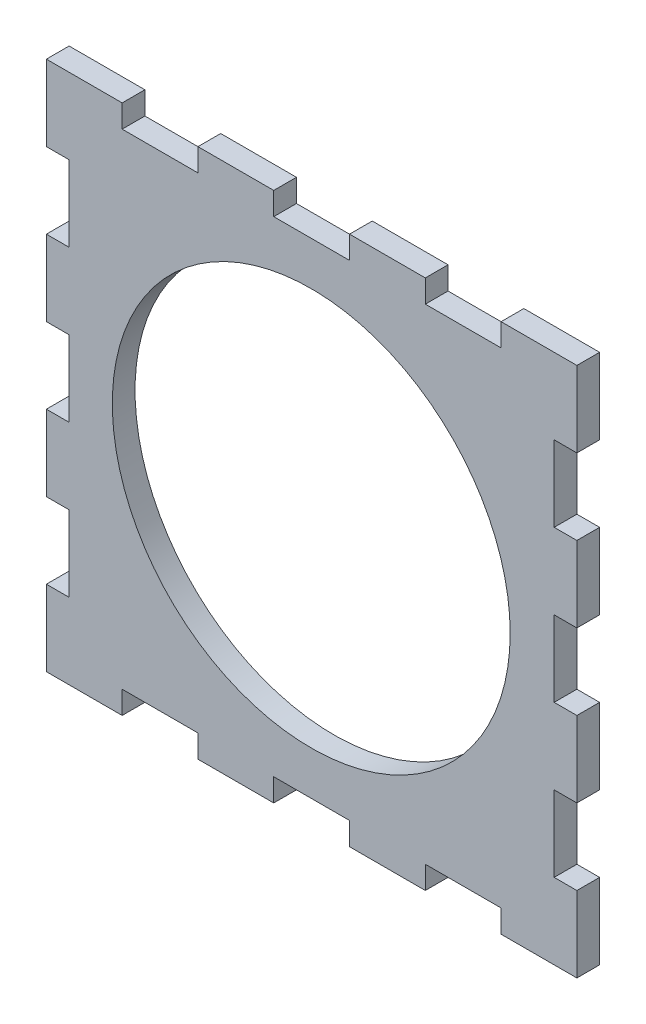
ISO-10303-21;
HEADER;
FILE_DESCRIPTION(('STEP AP214'),'2;1');
FILE_NAME('part.step','',(''),(''),'','','');
FILE_SCHEMA(('AUTOMOTIVE_DESIGN { 1 0 10303 214 1 1 1 1 }'));
ENDSEC;
DATA;
#1=APPLICATION_CONTEXT('core data for automotive mechanical design processes');
#2=APPLICATION_PROTOCOL_DEFINITION('international standard','automotive_design',2000,#1);
#3=PRODUCT_CONTEXT('',#1,'mechanical');
#4=PRODUCT('Part','Part','',(#3));
#5=PRODUCT_RELATED_PRODUCT_CATEGORY('part','',(#4));
#6=PRODUCT_DEFINITION_FORMATION('','',#4);
#7=PRODUCT_DEFINITION_CONTEXT('part definition',#1,'design');
#8=PRODUCT_DEFINITION('design','',#6,#7);
#9=PRODUCT_DEFINITION_SHAPE('','',#8);
#10=(LENGTH_UNIT() NAMED_UNIT(*) SI_UNIT(.MILLI.,.METRE.));
#11=(NAMED_UNIT(*) PLANE_ANGLE_UNIT() SI_UNIT($,.RADIAN.));
#12=(NAMED_UNIT(*) SI_UNIT($,.STERADIAN.) SOLID_ANGLE_UNIT());
#13=UNCERTAINTY_MEASURE_WITH_UNIT(LENGTH_MEASURE(1.E-05),#10,'distance_accuracy_value','');
#14=(GEOMETRIC_REPRESENTATION_CONTEXT(3) GLOBAL_UNCERTAINTY_ASSIGNED_CONTEXT((#13)) GLOBAL_UNIT_ASSIGNED_CONTEXT((#10,
#11,#12)) REPRESENTATION_CONTEXT('',''));
#15=CARTESIAN_POINT('',(0.,0.,0.));
#16=DIRECTION('',(0.,0.,1.));
#17=DIRECTION('',(1.,0.,0.));
#18=AXIS2_PLACEMENT_3D('',#15,#16,#17);
#19=CARTESIAN_POINT('',(41.3114754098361,13.1967213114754,3.));
#20=DIRECTION('',(-1.,0.,0.));
#21=DIRECTION('',(0.,-1.,0.));
#22=AXIS2_PLACEMENT_3D('',#19,#20,#21);
#23=PLANE('',#22);
#24=DIRECTION('',(0.,1.,0.));
#25=VECTOR('',#24,1.);
#26=CARTESIAN_POINT('',(41.3114754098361,13.1967213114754,0.));
#27=LINE('',#26,#25);
#28=CARTESIAN_POINT('',(41.3114754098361,-36.8032786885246,0.));
#29=VERTEX_POINT('',#28);
#30=CARTESIAN_POINT('',(41.3114754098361,-26.8032786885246,0.));
#31=VERTEX_POINT('',#30);
#32=EDGE_CURVE('E386',#29,#31,#27,.T.);
#33=ORIENTED_EDGE('',*,*,#32,.T.);
#34=DIRECTION('',(0.,0.,1.));
#35=VECTOR('',#34,1.);
#36=CARTESIAN_POINT('',(41.3114754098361,-26.8032786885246,0.));
#37=LINE('',#36,#35);
#38=CARTESIAN_POINT('',(41.3114754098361,-26.8032786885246,3.));
#39=VERTEX_POINT('',#38);
#40=EDGE_CURVE('E1093',#31,#39,#37,.T.);
#41=ORIENTED_EDGE('',*,*,#40,.T.);
#42=DIRECTION('',(0.,1.,0.));
#43=VECTOR('',#42,1.);
#44=CARTESIAN_POINT('',(41.3114754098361,13.1967213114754,3.));
#45=LINE('',#44,#43);
#46=CARTESIAN_POINT('',(41.3114754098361,-36.8032786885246,3.));
#47=VERTEX_POINT('',#46);
#48=EDGE_CURVE('E517',#47,#39,#45,.T.);
#49=ORIENTED_EDGE('',*,*,#48,.F.);
#50=DIRECTION('',(0.,0.,1.));
#51=VECTOR('',#50,1.);
#52=CARTESIAN_POINT('',(41.3114754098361,-36.8032786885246,0.));
#53=LINE('',#52,#51);
#54=EDGE_CURVE('E1108',#29,#47,#53,.T.);
#55=ORIENTED_EDGE('',*,*,#54,.F.);
#56=EDGE_LOOP('',(#33,#41,#49,#55));
#57=FACE_BOUND('',#56,.T.);
#58=ADVANCED_FACE('F33',(#57),#23,.F.);
#59=CARTESIAN_POINT('',(41.3114754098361,-56.8032786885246,0.));
#60=VERTEX_POINT('',#59);
#61=CARTESIAN_POINT('',(41.3114754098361,-46.8032786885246,0.));
#62=VERTEX_POINT('',#61);
#63=EDGE_CURVE('E389',#60,#62,#27,.T.);
#64=ORIENTED_EDGE('',*,*,#63,.T.);
#65=DIRECTION('',(0.,0.,1.));
#66=VECTOR('',#65,1.);
#67=CARTESIAN_POINT('',(41.3114754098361,-46.8032786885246,0.));
#68=LINE('',#67,#66);
#69=CARTESIAN_POINT('',(41.3114754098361,-46.8032786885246,3.));
#70=VERTEX_POINT('',#69);
#71=EDGE_CURVE('E1089',#62,#70,#68,.T.);
#72=ORIENTED_EDGE('',*,*,#71,.T.);
#73=CARTESIAN_POINT('',(41.3114754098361,-56.8032786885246,3.));
#74=VERTEX_POINT('',#73);
#75=EDGE_CURVE('E513',#74,#70,#45,.T.);
#76=ORIENTED_EDGE('',*,*,#75,.F.);
#77=DIRECTION('',(0.,0.,-1.));
#78=VECTOR('',#77,1.);
#79=CARTESIAN_POINT('',(41.3114754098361,-56.8032786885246,3.));
#80=LINE('',#79,#78);
#81=EDGE_CURVE('E41',#74,#60,#80,.T.);
#82=ORIENTED_EDGE('',*,*,#81,.T.);
#83=EDGE_LOOP('',(#64,#72,#76,#82));
#84=FACE_BOUND('',#83,.T.);
#85=ADVANCED_FACE('F703',(#84),#23,.F.);
#86=CARTESIAN_POINT('',(41.3114754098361,-16.8032786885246,3.));
#87=VERTEX_POINT('',#86);
#88=CARTESIAN_POINT('',(41.3114754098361,-6.80327868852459,3.));
#89=VERTEX_POINT('',#88);
#90=EDGE_CURVE('E378',#87,#89,#45,.T.);
#91=ORIENTED_EDGE('',*,*,#90,.F.);
#92=DIRECTION('',(0.,0.,1.));
#93=VECTOR('',#92,1.);
#94=CARTESIAN_POINT('',(41.3114754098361,-16.8032786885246,0.));
#95=LINE('',#94,#93);
#96=CARTESIAN_POINT('',(41.3114754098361,-16.8032786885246,0.));
#97=VERTEX_POINT('',#96);
#98=EDGE_CURVE('E365',#97,#87,#95,.T.);
#99=ORIENTED_EDGE('',*,*,#98,.F.);
#100=CARTESIAN_POINT('',(41.3114754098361,-6.80327868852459,0.));
#101=VERTEX_POINT('',#100);
#102=EDGE_CURVE('E376',#97,#101,#27,.T.);
#103=ORIENTED_EDGE('',*,*,#102,.T.);
#104=DIRECTION('',(0.,0.,1.));
#105=VECTOR('',#104,1.);
#106=CARTESIAN_POINT('',(41.3114754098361,-6.80327868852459,0.));
#107=LINE('',#106,#105);
#108=EDGE_CURVE('E1136',#101,#89,#107,.T.);
#109=ORIENTED_EDGE('',*,*,#108,.T.);
#110=EDGE_LOOP('',(#91,#99,#103,#109));
#111=FACE_BOUND('',#110,.T.);
#112=ADVANCED_FACE('F374',(#111),#23,.F.);
#113=CARTESIAN_POINT('',(-28.6885245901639,13.1967213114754,3.));
#114=DIRECTION('',(1.,0.,0.));
#115=DIRECTION('',(0.,1.,0.));
#116=AXIS2_PLACEMENT_3D('',#113,#114,#115);
#117=PLANE('',#116);
#118=DIRECTION('',(0.,-1.,0.));
#119=VECTOR('',#118,1.);
#120=CARTESIAN_POINT('',(-28.6885245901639,13.1967213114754,0.));
#121=LINE('',#120,#119);
#122=CARTESIAN_POINT('',(-28.6885245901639,-6.80327868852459,0.));
#123=VERTEX_POINT('',#122);
#124=CARTESIAN_POINT('',(-28.6885245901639,-16.8032786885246,0.));
#125=VERTEX_POINT('',#124);
#126=EDGE_CURVE('E527',#123,#125,#121,.T.);
#127=ORIENTED_EDGE('',*,*,#126,.T.);
#128=DIRECTION('',(0.,0.,1.));
#129=VECTOR('',#128,1.);
#130=CARTESIAN_POINT('',(-28.6885245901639,-16.8032786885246,0.));
#131=LINE('',#130,#129);
#132=CARTESIAN_POINT('',(-28.6885245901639,-16.8032786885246,3.));
#133=VERTEX_POINT('',#132);
#134=EDGE_CURVE('E1154',#125,#133,#131,.T.);
#135=ORIENTED_EDGE('',*,*,#134,.T.);
#136=DIRECTION('',(0.,-1.,0.));
#137=VECTOR('',#136,1.);
#138=CARTESIAN_POINT('',(-28.6885245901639,13.1967213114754,3.));
#139=LINE('',#138,#137);
#140=CARTESIAN_POINT('',(-28.6885245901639,-6.80327868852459,3.));
#141=VERTEX_POINT('',#140);
#142=EDGE_CURVE('E507',#141,#133,#139,.T.);
#143=ORIENTED_EDGE('',*,*,#142,.F.);
#144=DIRECTION('',(0.,0.,1.));
#145=VECTOR('',#144,1.);
#146=CARTESIAN_POINT('',(-28.6885245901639,-6.80327868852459,0.));
#147=LINE('',#146,#145);
#148=EDGE_CURVE('E641',#123,#141,#147,.T.);
#149=ORIENTED_EDGE('',*,*,#148,.F.);
#150=EDGE_LOOP('',(#127,#135,#143,#149));
#151=FACE_BOUND('',#150,.T.);
#152=ADVANCED_FACE('F722',(#151),#117,.F.);
#153=CARTESIAN_POINT('',(-28.6885245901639,-26.8032786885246,3.));
#154=VERTEX_POINT('',#153);
#155=CARTESIAN_POINT('',(-28.6885245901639,-36.8032786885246,3.));
#156=VERTEX_POINT('',#155);
#157=EDGE_CURVE('E1214',#154,#156,#139,.T.);
#158=ORIENTED_EDGE('',*,*,#157,.F.);
#159=DIRECTION('',(0.,0.,1.));
#160=VECTOR('',#159,1.);
#161=CARTESIAN_POINT('',(-28.6885245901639,-26.8032786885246,0.));
#162=LINE('',#161,#160);
#163=CARTESIAN_POINT('',(-28.6885245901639,-26.8032786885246,0.));
#164=VERTEX_POINT('',#163);
#165=EDGE_CURVE('E1168',#164,#154,#162,.T.);
#166=ORIENTED_EDGE('',*,*,#165,.F.);
#167=CARTESIAN_POINT('',(-28.6885245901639,-36.8032786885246,0.));
#168=VERTEX_POINT('',#167);
#169=EDGE_CURVE('E1226',#164,#168,#121,.T.);
#170=ORIENTED_EDGE('',*,*,#169,.T.);
#171=DIRECTION('',(0.,0.,1.));
#172=VECTOR('',#171,1.);
#173=CARTESIAN_POINT('',(-28.6885245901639,-36.8032786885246,0.));
#174=LINE('',#173,#172);
#175=EDGE_CURVE('E1182',#168,#156,#174,.T.);
#176=ORIENTED_EDGE('',*,*,#175,.T.);
#177=EDGE_LOOP('',(#158,#166,#170,#176));
#178=FACE_BOUND('',#177,.T.);
#179=ADVANCED_FACE('F726',(#178),#117,.F.);
#180=CARTESIAN_POINT('',(-28.6885245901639,13.1967213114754,0.));
#181=VERTEX_POINT('',#180);
#182=CARTESIAN_POINT('',(-28.6885245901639,3.19672131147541,0.));
#183=VERTEX_POINT('',#182);
#184=EDGE_CURVE('E524',#181,#183,#121,.T.);
#185=ORIENTED_EDGE('',*,*,#184,.T.);
#186=DIRECTION('',(0.,0.,1.));
#187=VECTOR('',#186,1.);
#188=CARTESIAN_POINT('',(-28.6885245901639,3.19672131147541,0.));
#189=LINE('',#188,#187);
#190=CARTESIAN_POINT('',(-28.6885245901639,3.19672131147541,3.));
#191=VERTEX_POINT('',#190);
#192=EDGE_CURVE('E571',#183,#191,#189,.T.);
#193=ORIENTED_EDGE('',*,*,#192,.T.);
#194=CARTESIAN_POINT('',(-28.6885245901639,13.1967213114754,3.));
#195=VERTEX_POINT('',#194);
#196=EDGE_CURVE('E503',#195,#191,#139,.T.);
#197=ORIENTED_EDGE('',*,*,#196,.F.);
#198=DIRECTION('',(0.,0.,-1.));
#199=VECTOR('',#198,1.);
#200=CARTESIAN_POINT('',(-28.6885245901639,13.1967213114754,3.));
#201=LINE('',#200,#199);
#202=EDGE_CURVE('E521',#195,#181,#201,.T.);
#203=ORIENTED_EDGE('',*,*,#202,.T.);
#204=EDGE_LOOP('',(#185,#193,#197,#203));
#205=FACE_BOUND('',#204,.T.);
#206=ADVANCED_FACE('F628',(#205),#117,.F.);
#207=CARTESIAN_POINT('',(-28.6885245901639,-56.8032786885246,3.));
#208=DIRECTION('',(0.,1.,0.));
#209=DIRECTION('',(0.,0.,1.));
#210=AXIS2_PLACEMENT_3D('',#207,#208,#209);
#211=PLANE('',#210);
#212=DIRECTION('',(1.,0.,0.));
#213=VECTOR('',#212,1.);
#214=CARTESIAN_POINT('',(-28.6885245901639,-56.8032786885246,0.));
#215=LINE('',#214,#213);
#216=CARTESIAN_POINT('',(-8.68852459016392,-56.8032786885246,0.));
#217=VERTEX_POINT('',#216);
#218=CARTESIAN_POINT('',(1.31147540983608,-56.8032786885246,0.));
#219=VERTEX_POINT('',#218);
#220=EDGE_CURVE('E529',#217,#219,#215,.T.);
#221=ORIENTED_EDGE('',*,*,#220,.T.);
#222=DIRECTION('',(0.,0.,1.));
#223=VECTOR('',#222,1.);
#224=CARTESIAN_POINT('',(1.31147540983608,-56.8032786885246,0.));
#225=LINE('',#224,#223);
#226=CARTESIAN_POINT('',(1.31147540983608,-56.8032786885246,3.));
#227=VERTEX_POINT('',#226);
#228=EDGE_CURVE('E595',#219,#227,#225,.T.);
#229=ORIENTED_EDGE('',*,*,#228,.T.);
#230=DIRECTION('',(1.,0.,0.));
#231=VECTOR('',#230,1.);
#232=CARTESIAN_POINT('',(-28.6885245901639,-56.8032786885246,3.));
#233=LINE('',#232,#231);
#234=CARTESIAN_POINT('',(-8.68852459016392,-56.8032786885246,3.));
#235=VERTEX_POINT('',#234);
#236=EDGE_CURVE('E512',#235,#227,#233,.T.);
#237=ORIENTED_EDGE('',*,*,#236,.F.);
#238=DIRECTION('',(0.,0.,1.));
#239=VECTOR('',#238,1.);
#240=CARTESIAN_POINT('',(-8.68852459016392,-56.8032786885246,0.));
#241=LINE('',#240,#239);
#242=EDGE_CURVE('E603',#217,#235,#241,.T.);
#243=ORIENTED_EDGE('',*,*,#242,.F.);
#244=EDGE_LOOP('',(#221,#229,#237,#243));
#245=FACE_BOUND('',#244,.T.);
#246=ADVANCED_FACE('F681',(#245),#211,.F.);
#247=CARTESIAN_POINT('',(11.3114754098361,-56.8032786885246,3.));
#248=VERTEX_POINT('',#247);
#249=CARTESIAN_POINT('',(21.3114754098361,-56.8032786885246,3.));
#250=VERTEX_POINT('',#249);
#251=EDGE_CURVE('E670',#248,#250,#233,.T.);
#252=ORIENTED_EDGE('',*,*,#251,.F.);
#253=DIRECTION('',(0.,0.,1.));
#254=VECTOR('',#253,1.);
#255=CARTESIAN_POINT('',(11.3114754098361,-56.8032786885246,0.));
#256=LINE('',#255,#254);
#257=CARTESIAN_POINT('',(11.3114754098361,-56.8032786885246,0.));
#258=VERTEX_POINT('',#257);
#259=EDGE_CURVE('E548',#258,#248,#256,.T.);
#260=ORIENTED_EDGE('',*,*,#259,.F.);
#261=CARTESIAN_POINT('',(21.3114754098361,-56.8032786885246,0.));
#262=VERTEX_POINT('',#261);
#263=EDGE_CURVE('E534',#258,#262,#215,.T.);
#264=ORIENTED_EDGE('',*,*,#263,.T.);
#265=DIRECTION('',(0.,0.,1.));
#266=VECTOR('',#265,1.);
#267=CARTESIAN_POINT('',(21.3114754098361,-56.8032786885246,0.));
#268=LINE('',#267,#266);
#269=EDGE_CURVE('E546',#262,#250,#268,.T.);
#270=ORIENTED_EDGE('',*,*,#269,.T.);
#271=EDGE_LOOP('',(#252,#260,#264,#270));
#272=FACE_BOUND('',#271,.T.);
#273=ADVANCED_FACE('F545',(#272),#211,.F.);
#274=CARTESIAN_POINT('',(-28.6885245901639,-56.8032786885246,0.));
#275=VERTEX_POINT('',#274);
#276=CARTESIAN_POINT('',(-18.6885245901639,-56.8032786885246,0.));
#277=VERTEX_POINT('',#276);
#278=EDGE_CURVE('E391',#275,#277,#215,.T.);
#279=ORIENTED_EDGE('',*,*,#278,.T.);
#280=DIRECTION('',(0.,0.,1.));
#281=VECTOR('',#280,1.);
#282=CARTESIAN_POINT('',(-18.6885245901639,-56.8032786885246,0.));
#283=LINE('',#282,#281);
#284=CARTESIAN_POINT('',(-18.6885245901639,-56.8032786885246,3.));
#285=VERTEX_POINT('',#284);
#286=EDGE_CURVE('E591',#277,#285,#283,.T.);
#287=ORIENTED_EDGE('',*,*,#286,.T.);
#288=CARTESIAN_POINT('',(-28.6885245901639,-56.8032786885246,3.));
#289=VERTEX_POINT('',#288);
#290=EDGE_CURVE('E508',#289,#285,#233,.T.);
#291=ORIENTED_EDGE('',*,*,#290,.F.);
#292=DIRECTION('',(0.,0.,-1.));
#293=VECTOR('',#292,1.);
#294=CARTESIAN_POINT('',(-28.6885245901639,-56.8032786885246,3.));
#295=LINE('',#294,#293);
#296=EDGE_CURVE('E11',#289,#275,#295,.T.);
#297=ORIENTED_EDGE('',*,*,#296,.T.);
#298=EDGE_LOOP('',(#279,#287,#291,#297));
#299=FACE_BOUND('',#298,.T.);
#300=ADVANCED_FACE('F719',(#299),#211,.F.);
#301=CARTESIAN_POINT('',(-28.6885245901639,13.1967213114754,3.));
#302=DIRECTION('',(0.,-1.,0.));
#303=DIRECTION('',(0.,0.,-1.));
#304=AXIS2_PLACEMENT_3D('',#301,#302,#303);
#305=PLANE('',#304);
#306=DIRECTION('',(-1.,0.,0.));
#307=VECTOR('',#306,1.);
#308=CARTESIAN_POINT('',(-28.6885245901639,13.1967213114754,3.));
#309=LINE('',#308,#307);
#310=CARTESIAN_POINT('',(1.31147540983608,13.1967213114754,3.));
#311=VERTEX_POINT('',#310);
#312=CARTESIAN_POINT('',(-8.68852459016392,13.1967213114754,3.));
#313=VERTEX_POINT('',#312);
#314=EDGE_CURVE('E523',#311,#313,#309,.T.);
#315=ORIENTED_EDGE('',*,*,#314,.F.);
#316=DIRECTION('',(0.,0.,1.));
#317=VECTOR('',#316,1.);
#318=CARTESIAN_POINT('',(1.31147540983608,13.1967213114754,0.));
#319=LINE('',#318,#317);
#320=CARTESIAN_POINT('',(1.31147540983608,13.1967213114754,0.));
#321=VERTEX_POINT('',#320);
#322=EDGE_CURVE('E448',#321,#311,#319,.T.);
#323=ORIENTED_EDGE('',*,*,#322,.F.);
#324=DIRECTION('',(-1.,0.,0.));
#325=VECTOR('',#324,1.);
#326=CARTESIAN_POINT('',(-28.6885245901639,13.1967213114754,0.));
#327=LINE('',#326,#325);
#328=CARTESIAN_POINT('',(-8.68852459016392,13.1967213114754,0.));
#329=VERTEX_POINT('',#328);
#330=EDGE_CURVE('E400',#321,#329,#327,.T.);
#331=ORIENTED_EDGE('',*,*,#330,.T.);
#332=DIRECTION('',(0.,0.,1.));
#333=VECTOR('',#332,1.);
#334=CARTESIAN_POINT('',(-8.68852459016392,13.1967213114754,0.));
#335=LINE('',#334,#333);
#336=EDGE_CURVE('E497',#329,#313,#335,.T.);
#337=ORIENTED_EDGE('',*,*,#336,.T.);
#338=EDGE_LOOP('',(#315,#323,#331,#337));
#339=FACE_BOUND('',#338,.T.);
#340=ADVANCED_FACE('F612',(#339),#305,.F.);
#341=CARTESIAN_POINT('',(21.3114754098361,13.1967213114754,0.));
#342=VERTEX_POINT('',#341);
#343=CARTESIAN_POINT('',(11.3114754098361,13.1967213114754,0.));
#344=VERTEX_POINT('',#343);
#345=EDGE_CURVE('E402',#342,#344,#327,.T.);
#346=ORIENTED_EDGE('',*,*,#345,.T.);
#347=DIRECTION('',(0.,0.,1.));
#348=VECTOR('',#347,1.);
#349=CARTESIAN_POINT('',(11.3114754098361,13.1967213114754,0.));
#350=LINE('',#349,#348);
#351=CARTESIAN_POINT('',(11.3114754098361,13.1967213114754,3.));
#352=VERTEX_POINT('',#351);
#353=EDGE_CURVE('E418',#344,#352,#350,.T.);
#354=ORIENTED_EDGE('',*,*,#353,.T.);
#355=CARTESIAN_POINT('',(21.3114754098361,13.1967213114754,3.));
#356=VERTEX_POINT('',#355);
#357=EDGE_CURVE('E522',#356,#352,#309,.T.);
#358=ORIENTED_EDGE('',*,*,#357,.F.);
#359=DIRECTION('',(0.,0.,1.));
#360=VECTOR('',#359,1.);
#361=CARTESIAN_POINT('',(21.3114754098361,13.1967213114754,0.));
#362=LINE('',#361,#360);
#363=EDGE_CURVE('E420',#342,#356,#362,.T.);
#364=ORIENTED_EDGE('',*,*,#363,.F.);
#365=EDGE_LOOP('',(#346,#354,#358,#364));
#366=FACE_BOUND('',#365,.T.);
#367=ADVANCED_FACE('F416',(#366),#305,.F.);
#368=CARTESIAN_POINT('',(-18.6885245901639,13.1967213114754,3.));
#369=VERTEX_POINT('',#368);
#370=EDGE_CURVE('E516',#369,#195,#309,.T.);
#371=ORIENTED_EDGE('',*,*,#370,.F.);
#372=DIRECTION('',(0.,0.,1.));
#373=VECTOR('',#372,1.);
#374=CARTESIAN_POINT('',(-18.6885245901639,13.1967213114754,0.));
#375=LINE('',#374,#373);
#376=CARTESIAN_POINT('',(-18.6885245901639,13.1967213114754,0.));
#377=VERTEX_POINT('',#376);
#378=EDGE_CURVE('E494',#377,#369,#375,.T.);
#379=ORIENTED_EDGE('',*,*,#378,.F.);
#380=EDGE_CURVE('E395',#377,#181,#327,.T.);
#381=ORIENTED_EDGE('',*,*,#380,.T.);
#382=ORIENTED_EDGE('',*,*,#202,.F.);
#383=EDGE_LOOP('',(#371,#379,#381,#382));
#384=FACE_BOUND('',#383,.T.);
#385=ADVANCED_FACE('F623',(#384),#305,.F.);
#386=CARTESIAN_POINT('',(-28.6885245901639,-46.8032786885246,3.));
#387=VERTEX_POINT('',#386);
#388=EDGE_CURVE('E410',#387,#289,#139,.T.);
#389=ORIENTED_EDGE('',*,*,#388,.F.);
#390=DIRECTION('',(0.,0.,1.));
#391=VECTOR('',#390,1.);
#392=CARTESIAN_POINT('',(-28.6885245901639,-46.8032786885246,0.));
#393=LINE('',#392,#391);
#394=CARTESIAN_POINT('',(-28.6885245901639,-46.8032786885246,0.));
#395=VERTEX_POINT('',#394);
#396=EDGE_CURVE('E1192',#395,#387,#393,.T.);
#397=ORIENTED_EDGE('',*,*,#396,.F.);
#398=EDGE_CURVE('E496',#395,#275,#121,.T.);
#399=ORIENTED_EDGE('',*,*,#398,.T.);
#400=ORIENTED_EDGE('',*,*,#296,.F.);
#401=EDGE_LOOP('',(#389,#397,#399,#400));
#402=FACE_BOUND('',#401,.T.);
#403=ADVANCED_FACE('F35',(#402),#117,.F.);
#404=CARTESIAN_POINT('',(31.3114754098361,-56.8032786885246,3.));
#405=VERTEX_POINT('',#404);
#406=EDGE_CURVE('E506',#405,#74,#233,.T.);
#407=ORIENTED_EDGE('',*,*,#406,.F.);
#408=DIRECTION('',(0.,0.,1.));
#409=VECTOR('',#408,1.);
#410=CARTESIAN_POINT('',(31.3114754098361,-56.8032786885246,0.));
#411=LINE('',#410,#409);
#412=CARTESIAN_POINT('',(31.3114754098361,-56.8032786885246,0.));
#413=VERTEX_POINT('',#412);
#414=EDGE_CURVE('E559',#413,#405,#411,.T.);
#415=ORIENTED_EDGE('',*,*,#414,.F.);
#416=EDGE_CURVE('E526',#413,#60,#215,.T.);
#417=ORIENTED_EDGE('',*,*,#416,.T.);
#418=ORIENTED_EDGE('',*,*,#81,.F.);
#419=EDGE_LOOP('',(#407,#415,#417,#418));
#420=FACE_BOUND('',#419,.T.);
#421=ADVANCED_FACE('F668',(#420),#211,.F.);
#422=CARTESIAN_POINT('',(41.3114754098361,3.19672131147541,3.));
#423=VERTEX_POINT('',#422);
#424=CARTESIAN_POINT('',(41.3114754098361,13.1967213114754,3.));
#425=VERTEX_POINT('',#424);
#426=EDGE_CURVE('E511',#423,#425,#45,.T.);
#427=ORIENTED_EDGE('',*,*,#426,.F.);
#428=DIRECTION('',(0.,0.,1.));
#429=VECTOR('',#428,1.);
#430=CARTESIAN_POINT('',(41.3114754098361,3.19672131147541,0.));
#431=LINE('',#430,#429);
#432=CARTESIAN_POINT('',(41.3114754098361,3.19672131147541,0.));
#433=VERTEX_POINT('',#432);
#434=EDGE_CURVE('E1128',#433,#423,#431,.T.);
#435=ORIENTED_EDGE('',*,*,#434,.F.);
#436=CARTESIAN_POINT('',(41.3114754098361,13.1967213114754,0.));
#437=VERTEX_POINT('',#436);
#438=EDGE_CURVE('E387',#433,#437,#27,.T.);
#439=ORIENTED_EDGE('',*,*,#438,.T.);
#440=DIRECTION('',(0.,0.,-1.));
#441=VECTOR('',#440,1.);
#442=CARTESIAN_POINT('',(41.3114754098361,13.1967213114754,3.));
#443=LINE('',#442,#441);
#444=EDGE_CURVE('E626',#425,#437,#443,.T.);
#445=ORIENTED_EDGE('',*,*,#444,.F.);
#446=EDGE_LOOP('',(#427,#435,#439,#445));
#447=FACE_BOUND('',#446,.T.);
#448=ADVANCED_FACE('F706',(#447),#23,.F.);
#449=CARTESIAN_POINT('',(31.3114754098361,13.1967213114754,0.));
#450=VERTEX_POINT('',#449);
#451=EDGE_CURVE('E401',#437,#450,#327,.T.);
#452=ORIENTED_EDGE('',*,*,#451,.T.);
#453=DIRECTION('',(0.,0.,1.));
#454=VECTOR('',#453,1.);
#455=CARTESIAN_POINT('',(31.3114754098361,13.1967213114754,0.));
#456=LINE('',#455,#454);
#457=CARTESIAN_POINT('',(31.3114754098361,13.1967213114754,3.));
#458=VERTEX_POINT('',#457);
#459=EDGE_CURVE('E470',#450,#458,#456,.T.);
#460=ORIENTED_EDGE('',*,*,#459,.T.);
#461=EDGE_CURVE('E518',#425,#458,#309,.T.);
#462=ORIENTED_EDGE('',*,*,#461,.F.);
#463=ORIENTED_EDGE('',*,*,#444,.T.);
#464=EDGE_LOOP('',(#452,#460,#462,#463));
#465=FACE_BOUND('',#464,.T.);
#466=ADVANCED_FACE('F712',(#465),#305,.F.);
#467=CARTESIAN_POINT('',(0.,0.,3.));
#468=DIRECTION('',(0.,0.,1.));
#469=DIRECTION('',(1.,0.,0.));
#470=AXIS2_PLACEMENT_3D('',#467,#468,#469);
#471=PLANE('',#470);
#472=CARTESIAN_POINT('',(6.26047648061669,-21.8032786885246,3.));
#473=DIRECTION('',(0.,0.,1.));
#474=DIRECTION('',(1.,0.,0.));
#475=AXIS2_PLACEMENT_3D('',#472,#473,#474);
#476=CIRCLE('',#475,26.25);
#477=CARTESIAN_POINT('',(32.5104764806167,-21.8032786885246,3.));
#478=VERTEX_POINT('',#477);
#479=EDGE_CURVE('E1078',#478,#478,#476,.T.);
#480=ORIENTED_EDGE('',*,*,#479,.F.);
#481=EDGE_LOOP('',(#480));
#482=FACE_BOUND('',#481,.T.);
#483=DIRECTION('',(1.,0.,0.));
#484=VECTOR('',#483,1.);
#485=CARTESIAN_POINT('',(41.3114754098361,-26.8032786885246,3.));
#486=LINE('',#485,#484);
#487=CARTESIAN_POINT('',(38.3114754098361,-26.8032786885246,3.));
#488=VERTEX_POINT('',#487);
#489=EDGE_CURVE('E370',#488,#39,#486,.T.);
#490=ORIENTED_EDGE('',*,*,#489,.F.);
#491=DIRECTION('',(0.,-1.,0.));
#492=VECTOR('',#491,1.);
#493=CARTESIAN_POINT('',(38.3114754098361,-16.8032786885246,3.));
#494=LINE('',#493,#492);
#495=CARTESIAN_POINT('',(38.3114754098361,-16.8032786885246,3.));
#496=VERTEX_POINT('',#495);
#497=EDGE_CURVE('E1088',#496,#488,#494,.T.);
#498=ORIENTED_EDGE('',*,*,#497,.F.);
#499=DIRECTION('',(-1.,0.,0.));
#500=VECTOR('',#499,1.);
#501=CARTESIAN_POINT('',(41.3114754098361,-16.8032786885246,3.));
#502=LINE('',#501,#500);
#503=EDGE_CURVE('E1086',#87,#496,#502,.T.);
#504=ORIENTED_EDGE('',*,*,#503,.F.);
#505=ORIENTED_EDGE('',*,*,#90,.T.);
#506=DIRECTION('',(1.,0.,0.));
#507=VECTOR('',#506,1.);
#508=CARTESIAN_POINT('',(41.3114754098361,-6.80327868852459,3.));
#509=LINE('',#508,#507);
#510=CARTESIAN_POINT('',(38.3114754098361,-6.80327868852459,3.));
#511=VERTEX_POINT('',#510);
#512=EDGE_CURVE('E1125',#511,#89,#509,.T.);
#513=ORIENTED_EDGE('',*,*,#512,.F.);
#514=DIRECTION('',(0.,-1.,0.));
#515=VECTOR('',#514,1.);
#516=CARTESIAN_POINT('',(38.3114754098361,3.19672131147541,3.));
#517=LINE('',#516,#515);
#518=CARTESIAN_POINT('',(38.3114754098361,3.19672131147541,3.));
#519=VERTEX_POINT('',#518);
#520=EDGE_CURVE('E1131',#519,#511,#517,.T.);
#521=ORIENTED_EDGE('',*,*,#520,.F.);
#522=DIRECTION('',(-1.,0.,0.));
#523=VECTOR('',#522,1.);
#524=CARTESIAN_POINT('',(41.3114754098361,3.19672131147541,3.));
#525=LINE('',#524,#523);
#526=EDGE_CURVE('E1096',#423,#519,#525,.T.);
#527=ORIENTED_EDGE('',*,*,#526,.F.);
#528=ORIENTED_EDGE('',*,*,#426,.T.);
#529=ORIENTED_EDGE('',*,*,#461,.T.);
#530=DIRECTION('',(0.,1.,0.));
#531=VECTOR('',#530,1.);
#532=CARTESIAN_POINT('',(31.3114754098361,13.1967213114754,3.));
#533=LINE('',#532,#531);
#534=CARTESIAN_POINT('',(31.3114754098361,10.1967213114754,3.));
#535=VERTEX_POINT('',#534);
#536=EDGE_CURVE('E455',#535,#458,#533,.T.);
#537=ORIENTED_EDGE('',*,*,#536,.F.);
#538=DIRECTION('',(1.,0.,0.));
#539=VECTOR('',#538,1.);
#540=CARTESIAN_POINT('',(21.3114754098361,10.1967213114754,3.));
#541=LINE('',#540,#539);
#542=CARTESIAN_POINT('',(21.3114754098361,10.1967213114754,3.));
#543=VERTEX_POINT('',#542);
#544=EDGE_CURVE('E464',#543,#535,#541,.T.);
#545=ORIENTED_EDGE('',*,*,#544,.F.);
#546=DIRECTION('',(0.,-1.,0.));
#547=VECTOR('',#546,1.);
#548=CARTESIAN_POINT('',(21.3114754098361,13.1967213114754,3.));
#549=LINE('',#548,#547);
#550=EDGE_CURVE('E461',#356,#543,#549,.T.);
#551=ORIENTED_EDGE('',*,*,#550,.F.);
#552=ORIENTED_EDGE('',*,*,#357,.T.);
#553=DIRECTION('',(0.,1.,0.));
#554=VECTOR('',#553,1.);
#555=CARTESIAN_POINT('',(11.3114754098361,13.1967213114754,3.));
#556=LINE('',#555,#554);
#557=CARTESIAN_POINT('',(11.3114754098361,10.1967213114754,3.));
#558=VERTEX_POINT('',#557);
#559=EDGE_CURVE('E446',#558,#352,#556,.T.);
#560=ORIENTED_EDGE('',*,*,#559,.F.);
#561=DIRECTION('',(1.,0.,0.));
#562=VECTOR('',#561,1.);
#563=CARTESIAN_POINT('',(1.31147540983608,10.1967213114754,3.));
#564=LINE('',#563,#562);
#565=CARTESIAN_POINT('',(1.31147540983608,10.1967213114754,3.));
#566=VERTEX_POINT('',#565);
#567=EDGE_CURVE('E443',#566,#558,#564,.T.);
#568=ORIENTED_EDGE('',*,*,#567,.F.);
#569=DIRECTION('',(0.,-1.,0.));
#570=VECTOR('',#569,1.);
#571=CARTESIAN_POINT('',(1.31147540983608,13.1967213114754,3.));
#572=LINE('',#571,#570);
#573=EDGE_CURVE('E440',#311,#566,#572,.T.);
#574=ORIENTED_EDGE('',*,*,#573,.F.);
#575=ORIENTED_EDGE('',*,*,#314,.T.);
#576=DIRECTION('',(0.,1.,0.));
#577=VECTOR('',#576,1.);
#578=CARTESIAN_POINT('',(-8.68852459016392,13.1967213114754,3.));
#579=LINE('',#578,#577);
#580=CARTESIAN_POINT('',(-8.68852459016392,10.1967213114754,3.));
#581=VERTEX_POINT('',#580);
#582=EDGE_CURVE('E480',#581,#313,#579,.T.);
#583=ORIENTED_EDGE('',*,*,#582,.F.);
#584=DIRECTION('',(1.,0.,0.));
#585=VECTOR('',#584,1.);
#586=CARTESIAN_POINT('',(-18.6885245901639,10.1967213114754,3.));
#587=LINE('',#586,#585);
#588=CARTESIAN_POINT('',(-18.6885245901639,10.1967213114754,3.));
#589=VERTEX_POINT('',#588);
#590=EDGE_CURVE('E489',#589,#581,#587,.T.);
#591=ORIENTED_EDGE('',*,*,#590,.F.);
#592=DIRECTION('',(0.,-1.,0.));
#593=VECTOR('',#592,1.);
#594=CARTESIAN_POINT('',(-18.6885245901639,13.1967213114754,3.));
#595=LINE('',#594,#593);
#596=EDGE_CURVE('E450',#369,#589,#595,.T.);
#597=ORIENTED_EDGE('',*,*,#596,.F.);
#598=ORIENTED_EDGE('',*,*,#370,.T.);
#599=ORIENTED_EDGE('',*,*,#196,.T.);
#600=DIRECTION('',(-1.,0.,0.));
#601=VECTOR('',#600,1.);
#602=CARTESIAN_POINT('',(-28.6885245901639,3.19672131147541,3.));
#603=LINE('',#602,#601);
#604=CARTESIAN_POINT('',(-25.6885245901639,3.19672131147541,3.));
#605=VERTEX_POINT('',#604);
#606=EDGE_CURVE('E637',#605,#191,#603,.T.);
#607=ORIENTED_EDGE('',*,*,#606,.F.);
#608=DIRECTION('',(0.,1.,0.));
#609=VECTOR('',#608,1.);
#610=CARTESIAN_POINT('',(-25.6885245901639,3.19672131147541,3.));
#611=LINE('',#610,#609);
#612=CARTESIAN_POINT('',(-25.6885245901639,-6.80327868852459,3.));
#613=VERTEX_POINT('',#612);
#614=EDGE_CURVE('E1204',#613,#605,#611,.T.);
#615=ORIENTED_EDGE('',*,*,#614,.F.);
#616=DIRECTION('',(1.,0.,0.));
#617=VECTOR('',#616,1.);
#618=CARTESIAN_POINT('',(-28.6885245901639,-6.80327868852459,3.));
#619=LINE('',#618,#617);
#620=EDGE_CURVE('E1165',#141,#613,#619,.T.);
#621=ORIENTED_EDGE('',*,*,#620,.F.);
#622=ORIENTED_EDGE('',*,*,#142,.T.);
#623=DIRECTION('',(-1.,0.,0.));
#624=VECTOR('',#623,1.);
#625=CARTESIAN_POINT('',(-28.6885245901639,-16.8032786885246,3.));
#626=LINE('',#625,#624);
#627=CARTESIAN_POINT('',(-25.6885245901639,-16.8032786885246,3.));
#628=VERTEX_POINT('',#627);
#629=EDGE_CURVE('E1155',#628,#133,#626,.T.);
#630=ORIENTED_EDGE('',*,*,#629,.F.);
#631=DIRECTION('',(0.,1.,0.));
#632=VECTOR('',#631,1.);
#633=CARTESIAN_POINT('',(-25.6885245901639,-16.8032786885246,3.));
#634=LINE('',#633,#632);
#635=CARTESIAN_POINT('',(-25.6885245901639,-26.8032786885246,3.));
#636=VERTEX_POINT('',#635);
#637=EDGE_CURVE('E1148',#636,#628,#634,.T.);
#638=ORIENTED_EDGE('',*,*,#637,.F.);
#639=DIRECTION('',(1.,0.,0.));
#640=VECTOR('',#639,1.);
#641=CARTESIAN_POINT('',(-28.6885245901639,-26.8032786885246,3.));
#642=LINE('',#641,#640);
#643=EDGE_CURVE('E1157',#154,#636,#642,.T.);
#644=ORIENTED_EDGE('',*,*,#643,.F.);
#645=ORIENTED_EDGE('',*,*,#157,.T.);
#646=DIRECTION('',(-1.,0.,0.));
#647=VECTOR('',#646,1.);
#648=CARTESIAN_POINT('',(-28.6885245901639,-36.8032786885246,3.));
#649=LINE('',#648,#647);
#650=CARTESIAN_POINT('',(-25.6885245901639,-36.8032786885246,3.));
#651=VERTEX_POINT('',#650);
#652=EDGE_CURVE('E1138',#651,#156,#649,.T.);
#653=ORIENTED_EDGE('',*,*,#652,.F.);
#654=DIRECTION('',(0.,1.,0.));
#655=VECTOR('',#654,1.);
#656=CARTESIAN_POINT('',(-25.6885245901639,-36.8032786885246,3.));
#657=LINE('',#656,#655);
#658=CARTESIAN_POINT('',(-25.6885245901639,-46.8032786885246,3.));
#659=VERTEX_POINT('',#658);
#660=EDGE_CURVE('E1176',#659,#651,#657,.T.);
#661=ORIENTED_EDGE('',*,*,#660,.F.);
#662=DIRECTION('',(1.,0.,0.));
#663=VECTOR('',#662,1.);
#664=CARTESIAN_POINT('',(-28.6885245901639,-46.8032786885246,3.));
#665=LINE('',#664,#663);
#666=EDGE_CURVE('E1184',#387,#659,#665,.T.);
#667=ORIENTED_EDGE('',*,*,#666,.F.);
#668=ORIENTED_EDGE('',*,*,#388,.T.);
#669=ORIENTED_EDGE('',*,*,#290,.T.);
#670=DIRECTION('',(0.,-1.,0.));
#671=VECTOR('',#670,1.);
#672=CARTESIAN_POINT('',(-18.6885245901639,-56.8032786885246,3.));
#673=LINE('',#672,#671);
#674=CARTESIAN_POINT('',(-18.6885245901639,-53.8032786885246,3.));
#675=VERTEX_POINT('',#674);
#676=EDGE_CURVE('E592',#675,#285,#673,.T.);
#677=ORIENTED_EDGE('',*,*,#676,.F.);
#678=DIRECTION('',(-1.,0.,0.));
#679=VECTOR('',#678,1.);
#680=CARTESIAN_POINT('',(-18.6885245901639,-53.8032786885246,3.));
#681=LINE('',#680,#679);
#682=CARTESIAN_POINT('',(-8.68852459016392,-53.8032786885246,3.));
#683=VERTEX_POINT('',#682);
#684=EDGE_CURVE('E585',#683,#675,#681,.T.);
#685=ORIENTED_EDGE('',*,*,#684,.F.);
#686=DIRECTION('',(0.,1.,0.));
#687=VECTOR('',#686,1.);
#688=CARTESIAN_POINT('',(-8.68852459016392,-56.8032786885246,3.));
#689=LINE('',#688,#687);
#690=EDGE_CURVE('E594',#235,#683,#689,.T.);
#691=ORIENTED_EDGE('',*,*,#690,.F.);
#692=ORIENTED_EDGE('',*,*,#236,.T.);
#693=DIRECTION('',(0.,-1.,0.));
#694=VECTOR('',#693,1.);
#695=CARTESIAN_POINT('',(1.31147540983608,-56.8032786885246,3.));
#696=LINE('',#695,#694);
#697=CARTESIAN_POINT('',(1.31147540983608,-53.8032786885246,3.));
#698=VERTEX_POINT('',#697);
#699=EDGE_CURVE('E646',#698,#227,#696,.T.);
#700=ORIENTED_EDGE('',*,*,#699,.F.);
#701=DIRECTION('',(-1.,0.,0.));
#702=VECTOR('',#701,1.);
#703=CARTESIAN_POINT('',(1.31147540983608,-53.8032786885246,3.));
#704=LINE('',#703,#702);
#705=CARTESIAN_POINT('',(11.3114754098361,-53.8032786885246,3.));
#706=VERTEX_POINT('',#705);
#707=EDGE_CURVE('E653',#706,#698,#704,.T.);
#708=ORIENTED_EDGE('',*,*,#707,.F.);
#709=DIRECTION('',(0.,1.,0.));
#710=VECTOR('',#709,1.);
#711=CARTESIAN_POINT('',(11.3114754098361,-56.8032786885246,3.));
#712=LINE('',#711,#710);
#713=EDGE_CURVE('E577',#248,#706,#712,.T.);
#714=ORIENTED_EDGE('',*,*,#713,.F.);
#715=ORIENTED_EDGE('',*,*,#251,.T.);
#716=DIRECTION('',(0.,-1.,0.));
#717=VECTOR('',#716,1.);
#718=CARTESIAN_POINT('',(21.3114754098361,-56.8032786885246,3.));
#719=LINE('',#718,#717);
#720=CARTESIAN_POINT('',(21.3114754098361,-53.8032786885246,3.));
#721=VERTEX_POINT('',#720);
#722=EDGE_CURVE('E574',#721,#250,#719,.T.);
#723=ORIENTED_EDGE('',*,*,#722,.F.);
#724=DIRECTION('',(-1.,0.,0.));
#725=VECTOR('',#724,1.);
#726=CARTESIAN_POINT('',(21.3114754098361,-53.8032786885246,3.));
#727=LINE('',#726,#725);
#728=CARTESIAN_POINT('',(31.3114754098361,-53.8032786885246,3.));
#729=VERTEX_POINT('',#728);
#730=EDGE_CURVE('E570',#729,#721,#727,.T.);
#731=ORIENTED_EDGE('',*,*,#730,.F.);
#732=DIRECTION('',(0.,1.,0.));
#733=VECTOR('',#732,1.);
#734=CARTESIAN_POINT('',(31.3114754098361,-56.8032786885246,3.));
#735=LINE('',#734,#733);
#736=EDGE_CURVE('E567',#405,#729,#735,.T.);
#737=ORIENTED_EDGE('',*,*,#736,.F.);
#738=ORIENTED_EDGE('',*,*,#406,.T.);
#739=ORIENTED_EDGE('',*,*,#75,.T.);
#740=DIRECTION('',(1.,0.,0.));
#741=VECTOR('',#740,1.);
#742=CARTESIAN_POINT('',(41.3114754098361,-46.8032786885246,3.));
#743=LINE('',#742,#741);
#744=CARTESIAN_POINT('',(38.3114754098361,-46.8032786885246,3.));
#745=VERTEX_POINT('',#744);
#746=EDGE_CURVE('E1103',#745,#70,#743,.T.);
#747=ORIENTED_EDGE('',*,*,#746,.F.);
#748=DIRECTION('',(0.,-1.,0.));
#749=VECTOR('',#748,1.);
#750=CARTESIAN_POINT('',(38.3114754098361,-36.8032786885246,3.));
#751=LINE('',#750,#749);
#752=CARTESIAN_POINT('',(38.3114754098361,-36.8032786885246,3.));
#753=VERTEX_POINT('',#752);
#754=EDGE_CURVE('E1111',#753,#745,#751,.T.);
#755=ORIENTED_EDGE('',*,*,#754,.F.);
#756=DIRECTION('',(-1.,0.,0.));
#757=VECTOR('',#756,1.);
#758=CARTESIAN_POINT('',(41.3114754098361,-36.8032786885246,3.));
#759=LINE('',#758,#757);
#760=EDGE_CURVE('E1080',#47,#753,#759,.T.);
#761=ORIENTED_EDGE('',*,*,#760,.F.);
#762=ORIENTED_EDGE('',*,*,#48,.T.);
#763=EDGE_LOOP('',(#490,#498,#504,#505,#513,#521,#527,#528,#529,#537,#545,#551,#552,#560,#568,
#574,#575,#583,#591,#597,#598,#599,#607,#615,#621,#622,#630,#638,#644,#645,#653,#661,#667,#668,
#669,#677,#685,#691,#692,#700,#708,#714,#715,#723,#731,#737,#738,#739,#747,#755,#761,#762));
#764=FACE_BOUND('',#763,.T.);
#765=ADVANCED_FACE('F619',(#482,#764),#471,.T.);
#766=CARTESIAN_POINT('',(0.,0.,0.));
#767=DIRECTION('',(0.,0.,1.));
#768=DIRECTION('',(1.,0.,0.));
#769=AXIS2_PLACEMENT_3D('',#766,#767,#768);
#770=PLANE('',#769);
#771=CARTESIAN_POINT('',(6.26047648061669,-21.8032786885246,0.));
#772=DIRECTION('',(0.,0.,1.));
#773=DIRECTION('',(1.,0.,0.));
#774=AXIS2_PLACEMENT_3D('',#771,#772,#773);
#775=CIRCLE('',#774,26.25);
#776=CARTESIAN_POINT('',(32.5104764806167,-21.8032786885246,0.));
#777=VERTEX_POINT('',#776);
#778=EDGE_CURVE('E1075',#777,#777,#775,.T.);
#779=ORIENTED_EDGE('',*,*,#778,.T.);
#780=EDGE_LOOP('',(#779));
#781=FACE_BOUND('',#780,.T.);
#782=DIRECTION('',(0.,-1.,0.));
#783=VECTOR('',#782,1.);
#784=CARTESIAN_POINT('',(38.3114754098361,-16.8032786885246,0.));
#785=LINE('',#784,#783);
#786=CARTESIAN_POINT('',(38.3114754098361,-16.8032786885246,0.));
#787=VERTEX_POINT('',#786);
#788=CARTESIAN_POINT('',(38.3114754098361,-26.8032786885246,0.));
#789=VERTEX_POINT('',#788);
#790=EDGE_CURVE('E48',#787,#789,#785,.T.);
#791=ORIENTED_EDGE('',*,*,#790,.T.);
#792=DIRECTION('',(1.,0.,0.));
#793=VECTOR('',#792,1.);
#794=CARTESIAN_POINT('',(41.3114754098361,-26.8032786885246,0.));
#795=LINE('',#794,#793);
#796=EDGE_CURVE('E379',#789,#31,#795,.T.);
#797=ORIENTED_EDGE('',*,*,#796,.T.);
#798=ORIENTED_EDGE('',*,*,#32,.F.);
#799=DIRECTION('',(-1.,0.,0.));
#800=VECTOR('',#799,1.);
#801=CARTESIAN_POINT('',(41.3114754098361,-36.8032786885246,0.));
#802=LINE('',#801,#800);
#803=CARTESIAN_POINT('',(38.3114754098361,-36.8032786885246,0.));
#804=VERTEX_POINT('',#803);
#805=EDGE_CURVE('E1100',#29,#804,#802,.T.);
#806=ORIENTED_EDGE('',*,*,#805,.T.);
#807=DIRECTION('',(0.,-1.,0.));
#808=VECTOR('',#807,1.);
#809=CARTESIAN_POINT('',(38.3114754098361,-36.8032786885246,0.));
#810=LINE('',#809,#808);
#811=CARTESIAN_POINT('',(38.3114754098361,-46.8032786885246,0.));
#812=VERTEX_POINT('',#811);
#813=EDGE_CURVE('E56',#804,#812,#810,.T.);
#814=ORIENTED_EDGE('',*,*,#813,.T.);
#815=DIRECTION('',(1.,0.,0.));
#816=VECTOR('',#815,1.);
#817=CARTESIAN_POINT('',(41.3114754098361,-46.8032786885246,0.));
#818=LINE('',#817,#816);
#819=EDGE_CURVE('E1105',#812,#62,#818,.T.);
#820=ORIENTED_EDGE('',*,*,#819,.T.);
#821=ORIENTED_EDGE('',*,*,#63,.F.);
#822=ORIENTED_EDGE('',*,*,#416,.F.);
#823=DIRECTION('',(0.,1.,0.));
#824=VECTOR('',#823,1.);
#825=CARTESIAN_POINT('',(31.3114754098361,-56.8032786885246,0.));
#826=LINE('',#825,#824);
#827=CARTESIAN_POINT('',(31.3114754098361,-53.8032786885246,0.));
#828=VERTEX_POINT('',#827);
#829=EDGE_CURVE('E563',#413,#828,#826,.T.);
#830=ORIENTED_EDGE('',*,*,#829,.T.);
#831=DIRECTION('',(-1.,0.,0.));
#832=VECTOR('',#831,1.);
#833=CARTESIAN_POINT('',(21.3114754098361,-53.8032786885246,0.));
#834=LINE('',#833,#832);
#835=CARTESIAN_POINT('',(21.3114754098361,-53.8032786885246,0.));
#836=VERTEX_POINT('',#835);
#837=EDGE_CURVE('E557',#828,#836,#834,.T.);
#838=ORIENTED_EDGE('',*,*,#837,.T.);
#839=DIRECTION('',(0.,-1.,0.));
#840=VECTOR('',#839,1.);
#841=CARTESIAN_POINT('',(21.3114754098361,-56.8032786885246,0.));
#842=LINE('',#841,#840);
#843=EDGE_CURVE('E555',#836,#262,#842,.T.);
#844=ORIENTED_EDGE('',*,*,#843,.T.);
#845=ORIENTED_EDGE('',*,*,#263,.F.);
#846=DIRECTION('',(0.,1.,0.));
#847=VECTOR('',#846,1.);
#848=CARTESIAN_POINT('',(11.3114754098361,-56.8032786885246,0.));
#849=LINE('',#848,#847);
#850=CARTESIAN_POINT('',(11.3114754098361,-53.8032786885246,0.));
#851=VERTEX_POINT('',#850);
#852=EDGE_CURVE('E552',#258,#851,#849,.T.);
#853=ORIENTED_EDGE('',*,*,#852,.T.);
#854=DIRECTION('',(-1.,0.,0.));
#855=VECTOR('',#854,1.);
#856=CARTESIAN_POINT('',(1.31147540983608,-53.8032786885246,0.));
#857=LINE('',#856,#855);
#858=CARTESIAN_POINT('',(1.31147540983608,-53.8032786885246,0.));
#859=VERTEX_POINT('',#858);
#860=EDGE_CURVE('E645',#851,#859,#857,.T.);
#861=ORIENTED_EDGE('',*,*,#860,.T.);
#862=DIRECTION('',(0.,-1.,0.));
#863=VECTOR('',#862,1.);
#864=CARTESIAN_POINT('',(1.31147540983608,-56.8032786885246,0.));
#865=LINE('',#864,#863);
#866=EDGE_CURVE('E648',#859,#219,#865,.T.);
#867=ORIENTED_EDGE('',*,*,#866,.T.);
#868=ORIENTED_EDGE('',*,*,#220,.F.);
#869=DIRECTION('',(0.,1.,0.));
#870=VECTOR('',#869,1.);
#871=CARTESIAN_POINT('',(-8.68852459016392,-56.8032786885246,0.));
#872=LINE('',#871,#870);
#873=CARTESIAN_POINT('',(-8.68852459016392,-53.8032786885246,0.));
#874=VERTEX_POINT('',#873);
#875=EDGE_CURVE('E584',#217,#874,#872,.T.);
#876=ORIENTED_EDGE('',*,*,#875,.T.);
#877=DIRECTION('',(-1.,0.,0.));
#878=VECTOR('',#877,1.);
#879=CARTESIAN_POINT('',(-18.6885245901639,-53.8032786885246,0.));
#880=LINE('',#879,#878);
#881=CARTESIAN_POINT('',(-18.6885245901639,-53.8032786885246,0.));
#882=VERTEX_POINT('',#881);
#883=EDGE_CURVE('E588',#874,#882,#880,.T.);
#884=ORIENTED_EDGE('',*,*,#883,.T.);
#885=DIRECTION('',(0.,-1.,0.));
#886=VECTOR('',#885,1.);
#887=CARTESIAN_POINT('',(-18.6885245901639,-56.8032786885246,0.));
#888=LINE('',#887,#886);
#889=EDGE_CURVE('E581',#882,#277,#888,.T.);
#890=ORIENTED_EDGE('',*,*,#889,.T.);
#891=ORIENTED_EDGE('',*,*,#278,.F.);
#892=ORIENTED_EDGE('',*,*,#398,.F.);
#893=DIRECTION('',(1.,0.,0.));
#894=VECTOR('',#893,1.);
#895=CARTESIAN_POINT('',(-28.6885245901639,-46.8032786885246,0.));
#896=LINE('',#895,#894);
#897=CARTESIAN_POINT('',(-25.6885245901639,-46.8032786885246,0.));
#898=VERTEX_POINT('',#897);
#899=EDGE_CURVE('E1175',#395,#898,#896,.T.);
#900=ORIENTED_EDGE('',*,*,#899,.T.);
#901=DIRECTION('',(0.,1.,0.));
#902=VECTOR('',#901,1.);
#903=CARTESIAN_POINT('',(-25.6885245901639,-36.8032786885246,0.));
#904=LINE('',#903,#902);
#905=CARTESIAN_POINT('',(-25.6885245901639,-36.8032786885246,0.));
#906=VERTEX_POINT('',#905);
#907=EDGE_CURVE('E1179',#898,#906,#904,.T.);
#908=ORIENTED_EDGE('',*,*,#907,.T.);
#909=DIRECTION('',(-1.,0.,0.));
#910=VECTOR('',#909,1.);
#911=CARTESIAN_POINT('',(-28.6885245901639,-36.8032786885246,0.));
#912=LINE('',#911,#910);
#913=EDGE_CURVE('E1172',#906,#168,#912,.T.);
#914=ORIENTED_EDGE('',*,*,#913,.T.);
#915=ORIENTED_EDGE('',*,*,#169,.F.);
#916=DIRECTION('',(1.,0.,0.));
#917=VECTOR('',#916,1.);
#918=CARTESIAN_POINT('',(-28.6885245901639,-26.8032786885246,0.));
#919=LINE('',#918,#917);
#920=CARTESIAN_POINT('',(-25.6885245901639,-26.8032786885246,0.));
#921=VERTEX_POINT('',#920);
#922=EDGE_CURVE('E1147',#164,#921,#919,.T.);
#923=ORIENTED_EDGE('',*,*,#922,.T.);
#924=DIRECTION('',(0.,1.,0.));
#925=VECTOR('',#924,1.);
#926=CARTESIAN_POINT('',(-25.6885245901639,-16.8032786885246,0.));
#927=LINE('',#926,#925);
#928=CARTESIAN_POINT('',(-25.6885245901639,-16.8032786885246,0.));
#929=VERTEX_POINT('',#928);
#930=EDGE_CURVE('E1151',#921,#929,#927,.T.);
#931=ORIENTED_EDGE('',*,*,#930,.T.);
#932=DIRECTION('',(-1.,0.,0.));
#933=VECTOR('',#932,1.);
#934=CARTESIAN_POINT('',(-28.6885245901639,-16.8032786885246,0.));
#935=LINE('',#934,#933);
#936=EDGE_CURVE('E1144',#929,#125,#935,.T.);
#937=ORIENTED_EDGE('',*,*,#936,.T.);
#938=ORIENTED_EDGE('',*,*,#126,.F.);
#939=DIRECTION('',(1.,0.,0.));
#940=VECTOR('',#939,1.);
#941=CARTESIAN_POINT('',(-28.6885245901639,-6.80327868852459,0.));
#942=LINE('',#941,#940);
#943=CARTESIAN_POINT('',(-25.6885245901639,-6.80327868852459,0.));
#944=VERTEX_POINT('',#943);
#945=EDGE_CURVE('E1196',#123,#944,#942,.T.);
#946=ORIENTED_EDGE('',*,*,#945,.T.);
#947=DIRECTION('',(0.,1.,0.));
#948=VECTOR('',#947,1.);
#949=CARTESIAN_POINT('',(-25.6885245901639,3.19672131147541,0.));
#950=LINE('',#949,#948);
#951=CARTESIAN_POINT('',(-25.6885245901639,3.19672131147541,0.));
#952=VERTEX_POINT('',#951);
#953=EDGE_CURVE('E1199',#944,#952,#950,.T.);
#954=ORIENTED_EDGE('',*,*,#953,.T.);
#955=DIRECTION('',(-1.,0.,0.));
#956=VECTOR('',#955,1.);
#957=CARTESIAN_POINT('',(-28.6885245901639,3.19672131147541,0.));
#958=LINE('',#957,#956);
#959=EDGE_CURVE('E643',#952,#183,#958,.T.);
#960=ORIENTED_EDGE('',*,*,#959,.T.);
#961=ORIENTED_EDGE('',*,*,#184,.F.);
#962=ORIENTED_EDGE('',*,*,#380,.F.);
#963=DIRECTION('',(0.,-1.,0.));
#964=VECTOR('',#963,1.);
#965=CARTESIAN_POINT('',(-18.6885245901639,13.1967213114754,0.));
#966=LINE('',#965,#964);
#967=CARTESIAN_POINT('',(-18.6885245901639,10.1967213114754,0.));
#968=VERTEX_POINT('',#967);
#969=EDGE_CURVE('E476',#377,#968,#966,.T.);
#970=ORIENTED_EDGE('',*,*,#969,.T.);
#971=DIRECTION('',(1.,0.,0.));
#972=VECTOR('',#971,1.);
#973=CARTESIAN_POINT('',(-18.6885245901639,10.1967213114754,0.));
#974=LINE('',#973,#972);
#975=CARTESIAN_POINT('',(-8.68852459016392,10.1967213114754,0.));
#976=VERTEX_POINT('',#975);
#977=EDGE_CURVE('E479',#968,#976,#974,.T.);
#978=ORIENTED_EDGE('',*,*,#977,.T.);
#979=DIRECTION('',(0.,1.,0.));
#980=VECTOR('',#979,1.);
#981=CARTESIAN_POINT('',(-8.68852459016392,13.1967213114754,0.));
#982=LINE('',#981,#980);
#983=EDGE_CURVE('E483',#976,#329,#982,.T.);
#984=ORIENTED_EDGE('',*,*,#983,.T.);
#985=ORIENTED_EDGE('',*,*,#330,.F.);
#986=DIRECTION('',(0.,-1.,0.));
#987=VECTOR('',#986,1.);
#988=CARTESIAN_POINT('',(1.31147540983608,13.1967213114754,0.));
#989=LINE('',#988,#987);
#990=CARTESIAN_POINT('',(1.31147540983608,10.1967213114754,0.));
#991=VERTEX_POINT('',#990);
#992=EDGE_CURVE('E436',#321,#991,#989,.T.);
#993=ORIENTED_EDGE('',*,*,#992,.T.);
#994=DIRECTION('',(1.,0.,0.));
#995=VECTOR('',#994,1.);
#996=CARTESIAN_POINT('',(1.31147540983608,10.1967213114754,0.));
#997=LINE('',#996,#995);
#998=CARTESIAN_POINT('',(11.3114754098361,10.1967213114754,0.));
#999=VERTEX_POINT('',#998);
#1000=EDGE_CURVE('E429',#991,#999,#997,.T.);
#1001=ORIENTED_EDGE('',*,*,#1000,.T.);
#1002=DIRECTION('',(0.,1.,0.));
#1003=VECTOR('',#1002,1.);
#1004=CARTESIAN_POINT('',(11.3114754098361,13.1967213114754,0.));
#1005=LINE('',#1004,#1003);
#1006=EDGE_CURVE('E426',#999,#344,#1005,.T.);
#1007=ORIENTED_EDGE('',*,*,#1006,.T.);
#1008=ORIENTED_EDGE('',*,*,#345,.F.);
#1009=DIRECTION('',(0.,-1.,0.));
#1010=VECTOR('',#1009,1.);
#1011=CARTESIAN_POINT('',(21.3114754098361,13.1967213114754,0.));
#1012=LINE('',#1011,#1010);
#1013=CARTESIAN_POINT('',(21.3114754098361,10.1967213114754,0.));
#1014=VERTEX_POINT('',#1013);
#1015=EDGE_CURVE('E424',#342,#1014,#1012,.T.);
#1016=ORIENTED_EDGE('',*,*,#1015,.T.);
#1017=DIRECTION('',(1.,0.,0.));
#1018=VECTOR('',#1017,1.);
#1019=CARTESIAN_POINT('',(21.3114754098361,10.1967213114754,0.));
#1020=LINE('',#1019,#1018);
#1021=CARTESIAN_POINT('',(31.3114754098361,10.1967213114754,0.));
#1022=VERTEX_POINT('',#1021);
#1023=EDGE_CURVE('E454',#1014,#1022,#1020,.T.);
#1024=ORIENTED_EDGE('',*,*,#1023,.T.);
#1025=DIRECTION('',(0.,1.,0.));
#1026=VECTOR('',#1025,1.);
#1027=CARTESIAN_POINT('',(31.3114754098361,13.1967213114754,0.));
#1028=LINE('',#1027,#1026);
#1029=EDGE_CURVE('E457',#1022,#450,#1028,.T.);
#1030=ORIENTED_EDGE('',*,*,#1029,.T.);
#1031=ORIENTED_EDGE('',*,*,#451,.F.);
#1032=ORIENTED_EDGE('',*,*,#438,.F.);
#1033=DIRECTION('',(-1.,0.,0.));
#1034=VECTOR('',#1033,1.);
#1035=CARTESIAN_POINT('',(41.3114754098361,3.19672131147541,0.));
#1036=LINE('',#1035,#1034);
#1037=CARTESIAN_POINT('',(38.3114754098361,3.19672131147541,0.));
#1038=VERTEX_POINT('',#1037);
#1039=EDGE_CURVE('E1121',#433,#1038,#1036,.T.);
#1040=ORIENTED_EDGE('',*,*,#1039,.T.);
#1041=DIRECTION('',(0.,-1.,0.));
#1042=VECTOR('',#1041,1.);
#1043=CARTESIAN_POINT('',(38.3114754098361,3.19672131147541,0.));
#1044=LINE('',#1043,#1042);
#1045=CARTESIAN_POINT('',(38.3114754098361,-6.80327868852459,0.));
#1046=VERTEX_POINT('',#1045);
#1047=EDGE_CURVE('E1124',#1038,#1046,#1044,.T.);
#1048=ORIENTED_EDGE('',*,*,#1047,.T.);
#1049=DIRECTION('',(1.,0.,0.));
#1050=VECTOR('',#1049,1.);
#1051=CARTESIAN_POINT('',(41.3114754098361,-6.80327868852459,0.));
#1052=LINE('',#1051,#1050);
#1053=EDGE_CURVE('E385',#1046,#101,#1052,.T.);
#1054=ORIENTED_EDGE('',*,*,#1053,.T.);
#1055=ORIENTED_EDGE('',*,*,#102,.F.);
#1056=DIRECTION('',(-1.,0.,0.));
#1057=VECTOR('',#1056,1.);
#1058=CARTESIAN_POINT('',(41.3114754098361,-16.8032786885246,0.));
#1059=LINE('',#1058,#1057);
#1060=EDGE_CURVE('E361',#97,#787,#1059,.T.);
#1061=ORIENTED_EDGE('',*,*,#1060,.T.);
#1062=EDGE_LOOP('',(#791,#797,#798,#806,#814,#820,#821,#822,#830,#838,#844,#845,#853,#861,#867,
#868,#876,#884,#890,#891,#892,#900,#908,#914,#915,#923,#931,#937,#938,#946,#954,#960,#961,#962,
#970,#978,#984,#985,#993,#1001,#1007,#1008,#1016,#1024,#1030,#1031,#1032,#1040,#1048,#1054,
#1055,#1061));
#1063=FACE_BOUND('',#1062,.T.);
#1064=ADVANCED_FACE('F382',(#781,#1063),#770,.F.);
#1065=CARTESIAN_POINT('',(-18.6885245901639,13.1967213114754,0.));
#1066=DIRECTION('',(-1.,0.,0.));
#1067=DIRECTION('',(0.,0.,1.));
#1068=AXIS2_PLACEMENT_3D('',#1065,#1066,#1067);
#1069=PLANE('',#1068);
#1070=ORIENTED_EDGE('',*,*,#596,.T.);
#1071=DIRECTION('',(0.,0.,1.));
#1072=VECTOR('',#1071,1.);
#1073=CARTESIAN_POINT('',(-18.6885245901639,10.1967213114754,0.));
#1074=LINE('',#1073,#1072);
#1075=EDGE_CURVE('E486',#968,#589,#1074,.T.);
#1076=ORIENTED_EDGE('',*,*,#1075,.F.);
#1077=ORIENTED_EDGE('',*,*,#969,.F.);
#1078=ORIENTED_EDGE('',*,*,#378,.T.);
#1079=EDGE_LOOP('',(#1070,#1076,#1077,#1078));
#1080=FACE_BOUND('',#1079,.T.);
#1081=ADVANCED_FACE('F758',(#1080),#1069,.F.);
#1082=CARTESIAN_POINT('',(-8.68852459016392,13.1967213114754,0.));
#1083=DIRECTION('',(1.,0.,0.));
#1084=DIRECTION('',(0.,0.,-1.));
#1085=AXIS2_PLACEMENT_3D('',#1082,#1083,#1084);
#1086=PLANE('',#1085);
#1087=ORIENTED_EDGE('',*,*,#582,.T.);
#1088=ORIENTED_EDGE('',*,*,#336,.F.);
#1089=ORIENTED_EDGE('',*,*,#983,.F.);
#1090=DIRECTION('',(0.,0.,1.));
#1091=VECTOR('',#1090,1.);
#1092=CARTESIAN_POINT('',(-8.68852459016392,10.1967213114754,0.));
#1093=LINE('',#1092,#1091);
#1094=EDGE_CURVE('E500',#976,#581,#1093,.T.);
#1095=ORIENTED_EDGE('',*,*,#1094,.T.);
#1096=EDGE_LOOP('',(#1087,#1088,#1089,#1095));
#1097=FACE_BOUND('',#1096,.T.);
#1098=ADVANCED_FACE('F765',(#1097),#1086,.F.);
#1099=CARTESIAN_POINT('',(-18.6885245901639,10.1967213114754,0.));
#1100=DIRECTION('',(0.,-1.,0.));
#1101=DIRECTION('',(1.,0.,0.));
#1102=AXIS2_PLACEMENT_3D('',#1099,#1100,#1101);
#1103=PLANE('',#1102);
#1104=ORIENTED_EDGE('',*,*,#590,.T.);
#1105=ORIENTED_EDGE('',*,*,#1094,.F.);
#1106=ORIENTED_EDGE('',*,*,#977,.F.);
#1107=ORIENTED_EDGE('',*,*,#1075,.T.);
#1108=EDGE_LOOP('',(#1104,#1105,#1106,#1107));
#1109=FACE_BOUND('',#1108,.T.);
#1110=ADVANCED_FACE('F767',(#1109),#1103,.F.);
#1111=CARTESIAN_POINT('',(21.3114754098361,13.1967213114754,0.));
#1112=DIRECTION('',(-1.,0.,0.));
#1113=DIRECTION('',(0.,0.,1.));
#1114=AXIS2_PLACEMENT_3D('',#1111,#1112,#1113);
#1115=PLANE('',#1114);
#1116=ORIENTED_EDGE('',*,*,#550,.T.);
#1117=DIRECTION('',(0.,0.,1.));
#1118=VECTOR('',#1117,1.);
#1119=CARTESIAN_POINT('',(21.3114754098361,10.1967213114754,0.));
#1120=LINE('',#1119,#1118);
#1121=EDGE_CURVE('E460',#1014,#543,#1120,.T.);
#1122=ORIENTED_EDGE('',*,*,#1121,.F.);
#1123=ORIENTED_EDGE('',*,*,#1015,.F.);
#1124=ORIENTED_EDGE('',*,*,#363,.T.);
#1125=EDGE_LOOP('',(#1116,#1122,#1123,#1124));
#1126=FACE_BOUND('',#1125,.T.);
#1127=ADVANCED_FACE('F770',(#1126),#1115,.F.);
#1128=CARTESIAN_POINT('',(31.3114754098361,13.1967213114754,0.));
#1129=DIRECTION('',(1.,0.,0.));
#1130=DIRECTION('',(0.,0.,-1.));
#1131=AXIS2_PLACEMENT_3D('',#1128,#1129,#1130);
#1132=PLANE('',#1131);
#1133=ORIENTED_EDGE('',*,*,#536,.T.);
#1134=ORIENTED_EDGE('',*,*,#459,.F.);
#1135=ORIENTED_EDGE('',*,*,#1029,.F.);
#1136=DIRECTION('',(0.,0.,1.));
#1137=VECTOR('',#1136,1.);
#1138=CARTESIAN_POINT('',(31.3114754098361,10.1967213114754,0.));
#1139=LINE('',#1138,#1137);
#1140=EDGE_CURVE('E473',#1022,#535,#1139,.T.);
#1141=ORIENTED_EDGE('',*,*,#1140,.T.);
#1142=EDGE_LOOP('',(#1133,#1134,#1135,#1141));
#1143=FACE_BOUND('',#1142,.T.);
#1144=ADVANCED_FACE('F777',(#1143),#1132,.F.);
#1145=CARTESIAN_POINT('',(21.3114754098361,10.1967213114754,0.));
#1146=DIRECTION('',(0.,-1.,0.));
#1147=DIRECTION('',(1.,0.,0.));
#1148=AXIS2_PLACEMENT_3D('',#1145,#1146,#1147);
#1149=PLANE('',#1148);
#1150=ORIENTED_EDGE('',*,*,#544,.T.);
#1151=ORIENTED_EDGE('',*,*,#1140,.F.);
#1152=ORIENTED_EDGE('',*,*,#1023,.F.);
#1153=ORIENTED_EDGE('',*,*,#1121,.T.);
#1154=EDGE_LOOP('',(#1150,#1151,#1152,#1153));
#1155=FACE_BOUND('',#1154,.T.);
#1156=ADVANCED_FACE('F779',(#1155),#1149,.F.);
#1157=CARTESIAN_POINT('',(1.31147540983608,13.1967213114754,0.));
#1158=DIRECTION('',(-1.,0.,0.));
#1159=DIRECTION('',(0.,0.,1.));
#1160=AXIS2_PLACEMENT_3D('',#1157,#1158,#1159);
#1161=PLANE('',#1160);
#1162=ORIENTED_EDGE('',*,*,#573,.T.);
#1163=DIRECTION('',(0.,0.,1.));
#1164=VECTOR('',#1163,1.);
#1165=CARTESIAN_POINT('',(1.31147540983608,10.1967213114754,0.));
#1166=LINE('',#1165,#1164);
#1167=EDGE_CURVE('E432',#991,#566,#1166,.T.);
#1168=ORIENTED_EDGE('',*,*,#1167,.F.);
#1169=ORIENTED_EDGE('',*,*,#992,.F.);
#1170=ORIENTED_EDGE('',*,*,#322,.T.);
#1171=EDGE_LOOP('',(#1162,#1168,#1169,#1170));
#1172=FACE_BOUND('',#1171,.T.);
#1173=ADVANCED_FACE('F608',(#1172),#1161,.F.);
#1174=CARTESIAN_POINT('',(11.3114754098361,13.1967213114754,0.));
#1175=DIRECTION('',(1.,0.,0.));
#1176=DIRECTION('',(0.,0.,-1.));
#1177=AXIS2_PLACEMENT_3D('',#1174,#1175,#1176);
#1178=PLANE('',#1177);
#1179=ORIENTED_EDGE('',*,*,#559,.T.);
#1180=ORIENTED_EDGE('',*,*,#353,.F.);
#1181=ORIENTED_EDGE('',*,*,#1006,.F.);
#1182=DIRECTION('',(0.,0.,1.));
#1183=VECTOR('',#1182,1.);
#1184=CARTESIAN_POINT('',(11.3114754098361,10.1967213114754,0.));
#1185=LINE('',#1184,#1183);
#1186=EDGE_CURVE('E434',#999,#558,#1185,.T.);
#1187=ORIENTED_EDGE('',*,*,#1186,.T.);
#1188=EDGE_LOOP('',(#1179,#1180,#1181,#1187));
#1189=FACE_BOUND('',#1188,.T.);
#1190=ADVANCED_FACE('F788',(#1189),#1178,.F.);
#1191=CARTESIAN_POINT('',(1.31147540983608,10.1967213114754,0.));
#1192=DIRECTION('',(0.,-1.,0.));
#1193=DIRECTION('',(1.,0.,0.));
#1194=AXIS2_PLACEMENT_3D('',#1191,#1192,#1193);
#1195=PLANE('',#1194);
#1196=ORIENTED_EDGE('',*,*,#567,.T.);
#1197=ORIENTED_EDGE('',*,*,#1186,.F.);
#1198=ORIENTED_EDGE('',*,*,#1000,.F.);
#1199=ORIENTED_EDGE('',*,*,#1167,.T.);
#1200=EDGE_LOOP('',(#1196,#1197,#1198,#1199));
#1201=FACE_BOUND('',#1200,.T.);
#1202=ADVANCED_FACE('F789',(#1201),#1195,.F.);
#1203=CARTESIAN_POINT('',(-18.6885245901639,-56.8032786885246,0.));
#1204=DIRECTION('',(-1.,0.,0.));
#1205=DIRECTION('',(0.,0.,1.));
#1206=AXIS2_PLACEMENT_3D('',#1203,#1204,#1205);
#1207=PLANE('',#1206);
#1208=ORIENTED_EDGE('',*,*,#676,.T.);
#1209=ORIENTED_EDGE('',*,*,#286,.F.);
#1210=ORIENTED_EDGE('',*,*,#889,.F.);
#1211=DIRECTION('',(0.,0.,1.));
#1212=VECTOR('',#1211,1.);
#1213=CARTESIAN_POINT('',(-18.6885245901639,-53.8032786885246,0.));
#1214=LINE('',#1213,#1212);
#1215=EDGE_CURVE('E465',#882,#675,#1214,.T.);
#1216=ORIENTED_EDGE('',*,*,#1215,.T.);
#1217=EDGE_LOOP('',(#1208,#1209,#1210,#1216));
#1218=FACE_BOUND('',#1217,.T.);
#1219=ADVANCED_FACE('F792',(#1218),#1207,.F.);
#1220=CARTESIAN_POINT('',(-18.6885245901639,-53.8032786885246,0.));
#1221=DIRECTION('',(0.,1.,0.));
#1222=DIRECTION('',(0.,0.,1.));
#1223=AXIS2_PLACEMENT_3D('',#1220,#1221,#1222);
#1224=PLANE('',#1223);
#1225=ORIENTED_EDGE('',*,*,#684,.T.);
#1226=ORIENTED_EDGE('',*,*,#1215,.F.);
#1227=ORIENTED_EDGE('',*,*,#883,.F.);
#1228=DIRECTION('',(0.,0.,1.));
#1229=VECTOR('',#1228,1.);
#1230=CARTESIAN_POINT('',(-8.68852459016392,-53.8032786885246,0.));
#1231=LINE('',#1230,#1229);
#1232=EDGE_CURVE('E601',#874,#683,#1231,.T.);
#1233=ORIENTED_EDGE('',*,*,#1232,.T.);
#1234=EDGE_LOOP('',(#1225,#1226,#1227,#1233));
#1235=FACE_BOUND('',#1234,.T.);
#1236=ADVANCED_FACE('F798',(#1235),#1224,.F.);
#1237=CARTESIAN_POINT('',(-8.68852459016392,-56.8032786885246,0.));
#1238=DIRECTION('',(1.,0.,0.));
#1239=DIRECTION('',(0.,0.,-1.));
#1240=AXIS2_PLACEMENT_3D('',#1237,#1238,#1239);
#1241=PLANE('',#1240);
#1242=ORIENTED_EDGE('',*,*,#690,.T.);
#1243=ORIENTED_EDGE('',*,*,#1232,.F.);
#1244=ORIENTED_EDGE('',*,*,#875,.F.);
#1245=ORIENTED_EDGE('',*,*,#242,.T.);
#1246=EDGE_LOOP('',(#1242,#1243,#1244,#1245));
#1247=FACE_BOUND('',#1246,.T.);
#1248=ADVANCED_FACE('F800',(#1247),#1241,.F.);
#1249=CARTESIAN_POINT('',(21.3114754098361,-56.8032786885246,0.));
#1250=DIRECTION('',(-1.,0.,0.));
#1251=DIRECTION('',(0.,0.,1.));
#1252=AXIS2_PLACEMENT_3D('',#1249,#1250,#1251);
#1253=PLANE('',#1252);
#1254=ORIENTED_EDGE('',*,*,#722,.T.);
#1255=ORIENTED_EDGE('',*,*,#269,.F.);
#1256=ORIENTED_EDGE('',*,*,#843,.F.);
#1257=DIRECTION('',(0.,0.,1.));
#1258=VECTOR('',#1257,1.);
#1259=CARTESIAN_POINT('',(21.3114754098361,-53.8032786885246,0.));
#1260=LINE('',#1259,#1258);
#1261=EDGE_CURVE('E578',#836,#721,#1260,.T.);
#1262=ORIENTED_EDGE('',*,*,#1261,.T.);
#1263=EDGE_LOOP('',(#1254,#1255,#1256,#1262));
#1264=FACE_BOUND('',#1263,.T.);
#1265=ADVANCED_FACE('F803',(#1264),#1253,.F.);
#1266=CARTESIAN_POINT('',(21.3114754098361,-53.8032786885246,0.));
#1267=DIRECTION('',(0.,1.,0.));
#1268=DIRECTION('',(0.,0.,1.));
#1269=AXIS2_PLACEMENT_3D('',#1266,#1267,#1268);
#1270=PLANE('',#1269);
#1271=ORIENTED_EDGE('',*,*,#730,.T.);
#1272=ORIENTED_EDGE('',*,*,#1261,.F.);
#1273=ORIENTED_EDGE('',*,*,#837,.F.);
#1274=DIRECTION('',(0.,0.,1.));
#1275=VECTOR('',#1274,1.);
#1276=CARTESIAN_POINT('',(31.3114754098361,-53.8032786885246,0.));
#1277=LINE('',#1276,#1275);
#1278=EDGE_CURVE('E561',#828,#729,#1277,.T.);
#1279=ORIENTED_EDGE('',*,*,#1278,.T.);
#1280=EDGE_LOOP('',(#1271,#1272,#1273,#1279));
#1281=FACE_BOUND('',#1280,.T.);
#1282=ADVANCED_FACE('F810',(#1281),#1270,.F.);
#1283=CARTESIAN_POINT('',(31.3114754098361,-56.8032786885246,0.));
#1284=DIRECTION('',(1.,0.,0.));
#1285=DIRECTION('',(0.,0.,-1.));
#1286=AXIS2_PLACEMENT_3D('',#1283,#1284,#1285);
#1287=PLANE('',#1286);
#1288=ORIENTED_EDGE('',*,*,#736,.T.);
#1289=ORIENTED_EDGE('',*,*,#1278,.F.);
#1290=ORIENTED_EDGE('',*,*,#829,.F.);
#1291=ORIENTED_EDGE('',*,*,#414,.T.);
#1292=EDGE_LOOP('',(#1288,#1289,#1290,#1291));
#1293=FACE_BOUND('',#1292,.T.);
#1294=ADVANCED_FACE('F665',(#1293),#1287,.F.);
#1295=CARTESIAN_POINT('',(1.31147540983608,-56.8032786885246,0.));
#1296=DIRECTION('',(-1.,0.,0.));
#1297=DIRECTION('',(0.,0.,1.));
#1298=AXIS2_PLACEMENT_3D('',#1295,#1296,#1297);
#1299=PLANE('',#1298);
#1300=ORIENTED_EDGE('',*,*,#699,.T.);
#1301=ORIENTED_EDGE('',*,*,#228,.F.);
#1302=ORIENTED_EDGE('',*,*,#866,.F.);
#1303=DIRECTION('',(0.,0.,1.));
#1304=VECTOR('',#1303,1.);
#1305=CARTESIAN_POINT('',(1.31147540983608,-53.8032786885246,0.));
#1306=LINE('',#1305,#1304);
#1307=EDGE_CURVE('E659',#859,#698,#1306,.T.);
#1308=ORIENTED_EDGE('',*,*,#1307,.T.);
#1309=EDGE_LOOP('',(#1300,#1301,#1302,#1308));
#1310=FACE_BOUND('',#1309,.T.);
#1311=ADVANCED_FACE('F685',(#1310),#1299,.F.);
#1312=CARTESIAN_POINT('',(1.31147540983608,-53.8032786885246,0.));
#1313=DIRECTION('',(0.,1.,0.));
#1314=DIRECTION('',(0.,0.,1.));
#1315=AXIS2_PLACEMENT_3D('',#1312,#1313,#1314);
#1316=PLANE('',#1315);
#1317=ORIENTED_EDGE('',*,*,#707,.T.);
#1318=ORIENTED_EDGE('',*,*,#1307,.F.);
#1319=ORIENTED_EDGE('',*,*,#860,.F.);
#1320=DIRECTION('',(0.,0.,1.));
#1321=VECTOR('',#1320,1.);
#1322=CARTESIAN_POINT('',(11.3114754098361,-53.8032786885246,0.));
#1323=LINE('',#1322,#1321);
#1324=EDGE_CURVE('E661',#851,#706,#1323,.T.);
#1325=ORIENTED_EDGE('',*,*,#1324,.T.);
#1326=EDGE_LOOP('',(#1317,#1318,#1319,#1325));
#1327=FACE_BOUND('',#1326,.T.);
#1328=ADVANCED_FACE('F688',(#1327),#1316,.F.);
#1329=CARTESIAN_POINT('',(11.3114754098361,-56.8032786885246,0.));
#1330=DIRECTION('',(1.,0.,0.));
#1331=DIRECTION('',(0.,0.,-1.));
#1332=AXIS2_PLACEMENT_3D('',#1329,#1330,#1331);
#1333=PLANE('',#1332);
#1334=ORIENTED_EDGE('',*,*,#713,.T.);
#1335=ORIENTED_EDGE('',*,*,#1324,.F.);
#1336=ORIENTED_EDGE('',*,*,#852,.F.);
#1337=ORIENTED_EDGE('',*,*,#259,.T.);
#1338=EDGE_LOOP('',(#1334,#1335,#1336,#1337));
#1339=FACE_BOUND('',#1338,.T.);
#1340=ADVANCED_FACE('F690',(#1339),#1333,.F.);
#1341=CARTESIAN_POINT('',(-28.6885245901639,3.19672131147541,0.));
#1342=DIRECTION('',(0.,1.,0.));
#1343=DIRECTION('',(0.,0.,1.));
#1344=AXIS2_PLACEMENT_3D('',#1341,#1342,#1343);
#1345=PLANE('',#1344);
#1346=ORIENTED_EDGE('',*,*,#606,.T.);
#1347=ORIENTED_EDGE('',*,*,#192,.F.);
#1348=ORIENTED_EDGE('',*,*,#959,.F.);
#1349=DIRECTION('',(0.,0.,1.));
#1350=VECTOR('',#1349,1.);
#1351=CARTESIAN_POINT('',(-25.6885245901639,3.19672131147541,0.));
#1352=LINE('',#1351,#1350);
#1353=EDGE_CURVE('E632',#952,#605,#1352,.T.);
#1354=ORIENTED_EDGE('',*,*,#1353,.T.);
#1355=EDGE_LOOP('',(#1346,#1347,#1348,#1354));
#1356=FACE_BOUND('',#1355,.T.);
#1357=ADVANCED_FACE('F692',(#1356),#1345,.F.);
#1358=CARTESIAN_POINT('',(-25.6885245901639,3.19672131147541,0.));
#1359=DIRECTION('',(1.,0.,0.));
#1360=DIRECTION('',(0.,0.,-1.));
#1361=AXIS2_PLACEMENT_3D('',#1358,#1359,#1360);
#1362=PLANE('',#1361);
#1363=ORIENTED_EDGE('',*,*,#614,.T.);
#1364=ORIENTED_EDGE('',*,*,#1353,.F.);
#1365=ORIENTED_EDGE('',*,*,#953,.F.);
#1366=DIRECTION('',(0.,0.,1.));
#1367=VECTOR('',#1366,1.);
#1368=CARTESIAN_POINT('',(-25.6885245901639,-6.80327868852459,0.));
#1369=LINE('',#1368,#1367);
#1370=EDGE_CURVE('E634',#944,#613,#1369,.T.);
#1371=ORIENTED_EDGE('',*,*,#1370,.T.);
#1372=EDGE_LOOP('',(#1363,#1364,#1365,#1371));
#1373=FACE_BOUND('',#1372,.T.);
#1374=ADVANCED_FACE('F698',(#1373),#1362,.F.);
#1375=CARTESIAN_POINT('',(-28.6885245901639,-6.80327868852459,0.));
#1376=DIRECTION('',(0.,-1.,0.));
#1377=DIRECTION('',(0.,0.,-1.));
#1378=AXIS2_PLACEMENT_3D('',#1375,#1376,#1377);
#1379=PLANE('',#1378);
#1380=ORIENTED_EDGE('',*,*,#620,.T.);
#1381=ORIENTED_EDGE('',*,*,#1370,.F.);
#1382=ORIENTED_EDGE('',*,*,#945,.F.);
#1383=ORIENTED_EDGE('',*,*,#148,.T.);
#1384=EDGE_LOOP('',(#1380,#1381,#1382,#1383));
#1385=FACE_BOUND('',#1384,.T.);
#1386=ADVANCED_FACE('F875',(#1385),#1379,.F.);
#1387=CARTESIAN_POINT('',(-28.6885245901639,-36.8032786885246,0.));
#1388=DIRECTION('',(0.,1.,0.));
#1389=DIRECTION('',(0.,0.,1.));
#1390=AXIS2_PLACEMENT_3D('',#1387,#1388,#1389);
#1391=PLANE('',#1390);
#1392=ORIENTED_EDGE('',*,*,#652,.T.);
#1393=ORIENTED_EDGE('',*,*,#175,.F.);
#1394=ORIENTED_EDGE('',*,*,#913,.F.);
#1395=DIRECTION('',(0.,0.,1.));
#1396=VECTOR('',#1395,1.);
#1397=CARTESIAN_POINT('',(-25.6885245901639,-36.8032786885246,0.));
#1398=LINE('',#1397,#1396);
#1399=EDGE_CURVE('E1158',#906,#651,#1398,.T.);
#1400=ORIENTED_EDGE('',*,*,#1399,.T.);
#1401=EDGE_LOOP('',(#1392,#1393,#1394,#1400));
#1402=FACE_BOUND('',#1401,.T.);
#1403=ADVANCED_FACE('F885',(#1402),#1391,.F.);
#1404=CARTESIAN_POINT('',(-25.6885245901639,-36.8032786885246,0.));
#1405=DIRECTION('',(1.,0.,0.));
#1406=DIRECTION('',(0.,0.,-1.));
#1407=AXIS2_PLACEMENT_3D('',#1404,#1405,#1406);
#1408=PLANE('',#1407);
#1409=ORIENTED_EDGE('',*,*,#660,.T.);
#1410=ORIENTED_EDGE('',*,*,#1399,.F.);
#1411=ORIENTED_EDGE('',*,*,#907,.F.);
#1412=DIRECTION('',(0.,0.,1.));
#1413=VECTOR('',#1412,1.);
#1414=CARTESIAN_POINT('',(-25.6885245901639,-46.8032786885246,0.));
#1415=LINE('',#1414,#1413);
#1416=EDGE_CURVE('E1190',#898,#659,#1415,.T.);
#1417=ORIENTED_EDGE('',*,*,#1416,.T.);
#1418=EDGE_LOOP('',(#1409,#1410,#1411,#1417));
#1419=FACE_BOUND('',#1418,.T.);
#1420=ADVANCED_FACE('F895',(#1419),#1408,.F.);
#1421=CARTESIAN_POINT('',(-28.6885245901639,-46.8032786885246,0.));
#1422=DIRECTION('',(0.,-1.,0.));
#1423=DIRECTION('',(0.,0.,-1.));
#1424=AXIS2_PLACEMENT_3D('',#1421,#1422,#1423);
#1425=PLANE('',#1424);
#1426=ORIENTED_EDGE('',*,*,#666,.T.);
#1427=ORIENTED_EDGE('',*,*,#1416,.F.);
#1428=ORIENTED_EDGE('',*,*,#899,.F.);
#1429=ORIENTED_EDGE('',*,*,#396,.T.);
#1430=EDGE_LOOP('',(#1426,#1427,#1428,#1429));
#1431=FACE_BOUND('',#1430,.T.);
#1432=ADVANCED_FACE('F905',(#1431),#1425,.F.);
#1433=CARTESIAN_POINT('',(-28.6885245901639,-16.8032786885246,0.));
#1434=DIRECTION('',(0.,1.,0.));
#1435=DIRECTION('',(0.,0.,1.));
#1436=AXIS2_PLACEMENT_3D('',#1433,#1434,#1435);
#1437=PLANE('',#1436);
#1438=ORIENTED_EDGE('',*,*,#629,.T.);
#1439=ORIENTED_EDGE('',*,*,#134,.F.);
#1440=ORIENTED_EDGE('',*,*,#936,.F.);
#1441=DIRECTION('',(0.,0.,1.));
#1442=VECTOR('',#1441,1.);
#1443=CARTESIAN_POINT('',(-25.6885245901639,-16.8032786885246,0.));
#1444=LINE('',#1443,#1442);
#1445=EDGE_CURVE('E1163',#929,#628,#1444,.T.);
#1446=ORIENTED_EDGE('',*,*,#1445,.T.);
#1447=EDGE_LOOP('',(#1438,#1439,#1440,#1446));
#1448=FACE_BOUND('',#1447,.T.);
#1449=ADVANCED_FACE('F915',(#1448),#1437,.F.);
#1450=CARTESIAN_POINT('',(-25.6885245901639,-16.8032786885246,0.));
#1451=DIRECTION('',(1.,0.,0.));
#1452=DIRECTION('',(0.,0.,-1.));
#1453=AXIS2_PLACEMENT_3D('',#1450,#1451,#1452);
#1454=PLANE('',#1453);
#1455=ORIENTED_EDGE('',*,*,#637,.T.);
#1456=ORIENTED_EDGE('',*,*,#1445,.F.);
#1457=ORIENTED_EDGE('',*,*,#930,.F.);
#1458=DIRECTION('',(0.,0.,1.));
#1459=VECTOR('',#1458,1.);
#1460=CARTESIAN_POINT('',(-25.6885245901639,-26.8032786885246,0.));
#1461=LINE('',#1460,#1459);
#1462=EDGE_CURVE('E1166',#921,#636,#1461,.T.);
#1463=ORIENTED_EDGE('',*,*,#1462,.T.);
#1464=EDGE_LOOP('',(#1455,#1456,#1457,#1463));
#1465=FACE_BOUND('',#1464,.T.);
#1466=ADVANCED_FACE('F925',(#1465),#1454,.F.);
#1467=CARTESIAN_POINT('',(-28.6885245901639,-26.8032786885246,0.));
#1468=DIRECTION('',(0.,-1.,0.));
#1469=DIRECTION('',(0.,0.,-1.));
#1470=AXIS2_PLACEMENT_3D('',#1467,#1468,#1469);
#1471=PLANE('',#1470);
#1472=ORIENTED_EDGE('',*,*,#643,.T.);
#1473=ORIENTED_EDGE('',*,*,#1462,.F.);
#1474=ORIENTED_EDGE('',*,*,#922,.F.);
#1475=ORIENTED_EDGE('',*,*,#165,.T.);
#1476=EDGE_LOOP('',(#1472,#1473,#1474,#1475));
#1477=FACE_BOUND('',#1476,.T.);
#1478=ADVANCED_FACE('F935',(#1477),#1471,.F.);
#1479=CARTESIAN_POINT('',(41.3114754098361,-6.80327868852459,0.));
#1480=DIRECTION('',(0.,-1.,0.));
#1481=DIRECTION('',(1.,0.,0.));
#1482=AXIS2_PLACEMENT_3D('',#1479,#1480,#1481);
#1483=PLANE('',#1482);
#1484=ORIENTED_EDGE('',*,*,#512,.T.);
#1485=ORIENTED_EDGE('',*,*,#108,.F.);
#1486=ORIENTED_EDGE('',*,*,#1053,.F.);
#1487=DIRECTION('',(0.,0.,1.));
#1488=VECTOR('',#1487,1.);
#1489=CARTESIAN_POINT('',(38.3114754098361,-6.80327868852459,0.));
#1490=LINE('',#1489,#1488);
#1491=EDGE_CURVE('E1139',#1046,#511,#1490,.T.);
#1492=ORIENTED_EDGE('',*,*,#1491,.T.);
#1493=EDGE_LOOP('',(#1484,#1485,#1486,#1492));
#1494=FACE_BOUND('',#1493,.T.);
#1495=ADVANCED_FACE('F944',(#1494),#1483,.F.);
#1496=CARTESIAN_POINT('',(38.3114754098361,3.19672131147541,0.));
#1497=DIRECTION('',(-1.,0.,0.));
#1498=DIRECTION('',(0.,0.,1.));
#1499=AXIS2_PLACEMENT_3D('',#1496,#1497,#1498);
#1500=PLANE('',#1499);
#1501=ORIENTED_EDGE('',*,*,#520,.T.);
#1502=ORIENTED_EDGE('',*,*,#1491,.F.);
#1503=ORIENTED_EDGE('',*,*,#1047,.F.);
#1504=DIRECTION('',(0.,0.,1.));
#1505=VECTOR('',#1504,1.);
#1506=CARTESIAN_POINT('',(38.3114754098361,3.19672131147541,0.));
#1507=LINE('',#1506,#1505);
#1508=EDGE_CURVE('E1141',#1038,#519,#1507,.T.);
#1509=ORIENTED_EDGE('',*,*,#1508,.T.);
#1510=EDGE_LOOP('',(#1501,#1502,#1503,#1509));
#1511=FACE_BOUND('',#1510,.T.);
#1512=ADVANCED_FACE('F974',(#1511),#1500,.F.);
#1513=CARTESIAN_POINT('',(41.3114754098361,3.19672131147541,0.));
#1514=DIRECTION('',(0.,1.,0.));
#1515=DIRECTION('',(-1.,0.,0.));
#1516=AXIS2_PLACEMENT_3D('',#1513,#1514,#1515);
#1517=PLANE('',#1516);
#1518=ORIENTED_EDGE('',*,*,#526,.T.);
#1519=ORIENTED_EDGE('',*,*,#1508,.F.);
#1520=ORIENTED_EDGE('',*,*,#1039,.F.);
#1521=ORIENTED_EDGE('',*,*,#434,.T.);
#1522=EDGE_LOOP('',(#1518,#1519,#1520,#1521));
#1523=FACE_BOUND('',#1522,.T.);
#1524=ADVANCED_FACE('F984',(#1523),#1517,.F.);
#1525=CARTESIAN_POINT('',(41.3114754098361,-46.8032786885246,0.));
#1526=DIRECTION('',(0.,-1.,0.));
#1527=DIRECTION('',(0.,0.,-1.));
#1528=AXIS2_PLACEMENT_3D('',#1525,#1526,#1527);
#1529=PLANE('',#1528);
#1530=ORIENTED_EDGE('',*,*,#746,.T.);
#1531=ORIENTED_EDGE('',*,*,#71,.F.);
#1532=ORIENTED_EDGE('',*,*,#819,.F.);
#1533=DIRECTION('',(0.,0.,1.));
#1534=VECTOR('',#1533,1.);
#1535=CARTESIAN_POINT('',(38.3114754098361,-46.8032786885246,0.));
#1536=LINE('',#1535,#1534);
#1537=EDGE_CURVE('E1116',#812,#745,#1536,.T.);
#1538=ORIENTED_EDGE('',*,*,#1537,.T.);
#1539=EDGE_LOOP('',(#1530,#1531,#1532,#1538));
#1540=FACE_BOUND('',#1539,.T.);
#1541=ADVANCED_FACE('F994',(#1540),#1529,.F.);
#1542=CARTESIAN_POINT('',(38.3114754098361,-36.8032786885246,0.));
#1543=DIRECTION('',(-1.,0.,0.));
#1544=DIRECTION('',(0.,0.,1.));
#1545=AXIS2_PLACEMENT_3D('',#1542,#1543,#1544);
#1546=PLANE('',#1545);
#1547=ORIENTED_EDGE('',*,*,#754,.T.);
#1548=ORIENTED_EDGE('',*,*,#1537,.F.);
#1549=ORIENTED_EDGE('',*,*,#813,.F.);
#1550=DIRECTION('',(0.,0.,1.));
#1551=VECTOR('',#1550,1.);
#1552=CARTESIAN_POINT('',(38.3114754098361,-36.8032786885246,0.));
#1553=LINE('',#1552,#1551);
#1554=EDGE_CURVE('E1118',#804,#753,#1553,.T.);
#1555=ORIENTED_EDGE('',*,*,#1554,.T.);
#1556=EDGE_LOOP('',(#1547,#1548,#1549,#1555));
#1557=FACE_BOUND('',#1556,.T.);
#1558=ADVANCED_FACE('F1004',(#1557),#1546,.F.);
#1559=CARTESIAN_POINT('',(41.3114754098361,-36.8032786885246,0.));
#1560=DIRECTION('',(0.,1.,0.));
#1561=DIRECTION('',(0.,0.,1.));
#1562=AXIS2_PLACEMENT_3D('',#1559,#1560,#1561);
#1563=PLANE('',#1562);
#1564=ORIENTED_EDGE('',*,*,#760,.T.);
#1565=ORIENTED_EDGE('',*,*,#1554,.F.);
#1566=ORIENTED_EDGE('',*,*,#805,.F.);
#1567=ORIENTED_EDGE('',*,*,#54,.T.);
#1568=EDGE_LOOP('',(#1564,#1565,#1566,#1567));
#1569=FACE_BOUND('',#1568,.T.);
#1570=ADVANCED_FACE('F1014',(#1569),#1563,.F.);
#1571=CARTESIAN_POINT('',(41.3114754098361,-26.8032786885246,0.));
#1572=DIRECTION('',(0.,-1.,0.));
#1573=DIRECTION('',(0.,0.,-1.));
#1574=AXIS2_PLACEMENT_3D('',#1571,#1572,#1573);
#1575=PLANE('',#1574);
#1576=ORIENTED_EDGE('',*,*,#489,.T.);
#1577=ORIENTED_EDGE('',*,*,#40,.F.);
#1578=ORIENTED_EDGE('',*,*,#796,.F.);
#1579=DIRECTION('',(0.,0.,1.));
#1580=VECTOR('',#1579,1.);
#1581=CARTESIAN_POINT('',(38.3114754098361,-26.8032786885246,0.));
#1582=LINE('',#1581,#1580);
#1583=EDGE_CURVE('E1097',#789,#488,#1582,.T.);
#1584=ORIENTED_EDGE('',*,*,#1583,.T.);
#1585=EDGE_LOOP('',(#1576,#1577,#1578,#1584));
#1586=FACE_BOUND('',#1585,.T.);
#1587=ADVANCED_FACE('F1023',(#1586),#1575,.F.);
#1588=CARTESIAN_POINT('',(38.3114754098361,-16.8032786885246,0.));
#1589=DIRECTION('',(-1.,0.,0.));
#1590=DIRECTION('',(0.,0.,1.));
#1591=AXIS2_PLACEMENT_3D('',#1588,#1589,#1590);
#1592=PLANE('',#1591);
#1593=ORIENTED_EDGE('',*,*,#497,.T.);
#1594=ORIENTED_EDGE('',*,*,#1583,.F.);
#1595=ORIENTED_EDGE('',*,*,#790,.F.);
#1596=DIRECTION('',(0.,0.,1.));
#1597=VECTOR('',#1596,1.);
#1598=CARTESIAN_POINT('',(38.3114754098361,-16.8032786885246,0.));
#1599=LINE('',#1598,#1597);
#1600=EDGE_CURVE('E367',#787,#496,#1599,.T.);
#1601=ORIENTED_EDGE('',*,*,#1600,.T.);
#1602=EDGE_LOOP('',(#1593,#1594,#1595,#1601));
#1603=FACE_BOUND('',#1602,.T.);
#1604=ADVANCED_FACE('F1033',(#1603),#1592,.F.);
#1605=CARTESIAN_POINT('',(41.3114754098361,-16.8032786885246,0.));
#1606=DIRECTION('',(0.,1.,0.));
#1607=DIRECTION('',(0.,0.,1.));
#1608=AXIS2_PLACEMENT_3D('',#1605,#1606,#1607);
#1609=PLANE('',#1608);
#1610=ORIENTED_EDGE('',*,*,#503,.T.);
#1611=ORIENTED_EDGE('',*,*,#1600,.F.);
#1612=ORIENTED_EDGE('',*,*,#1060,.F.);
#1613=ORIENTED_EDGE('',*,*,#98,.T.);
#1614=EDGE_LOOP('',(#1610,#1611,#1612,#1613));
#1615=FACE_BOUND('',#1614,.T.);
#1616=ADVANCED_FACE('F364',(#1615),#1609,.F.);
#1617=CARTESIAN_POINT('',(6.26047648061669,-21.8032786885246,0.));
#1618=DIRECTION('',(0.,0.,1.));
#1619=DIRECTION('',(1.,0.,0.));
#1620=AXIS2_PLACEMENT_3D('',#1617,#1618,#1619);
#1621=CYLINDRICAL_SURFACE('',#1620,26.25);
#1622=ORIENTED_EDGE('',*,*,#778,.F.);
#1623=EDGE_LOOP('',(#1622));
#1624=FACE_BOUND('',#1623,.T.);
#1625=ORIENTED_EDGE('',*,*,#479,.T.);
#1626=EDGE_LOOP('',(#1625));
#1627=FACE_BOUND('',#1626,.T.);
#1628=ADVANCED_FACE('F1050',(#1624,#1627),#1621,.F.);
#1629=CLOSED_SHELL('',(#58,#85,#112,#152,#179,#206,#246,#273,#300,#340,#367,#385,#403,#421,#448,
#466,#765,#1064,#1081,#1098,#1110,#1127,#1144,#1156,#1173,#1190,#1202,#1219,#1236,#1248,#1265,
#1282,#1294,#1311,#1328,#1340,#1357,#1374,#1386,#1403,#1420,#1432,#1449,#1466,#1478,#1495,#1512,
#1524,#1541,#1558,#1570,#1587,#1604,#1616,#1628));
#1630=MANIFOLD_SOLID_BREP('B2',#1629);
#1631=ADVANCED_BREP_SHAPE_REPRESENTATION('',(#18,#1630),#14);
#1632=SHAPE_DEFINITION_REPRESENTATION(#9,#1631);
ENDSEC;
END-ISO-10303-21;
